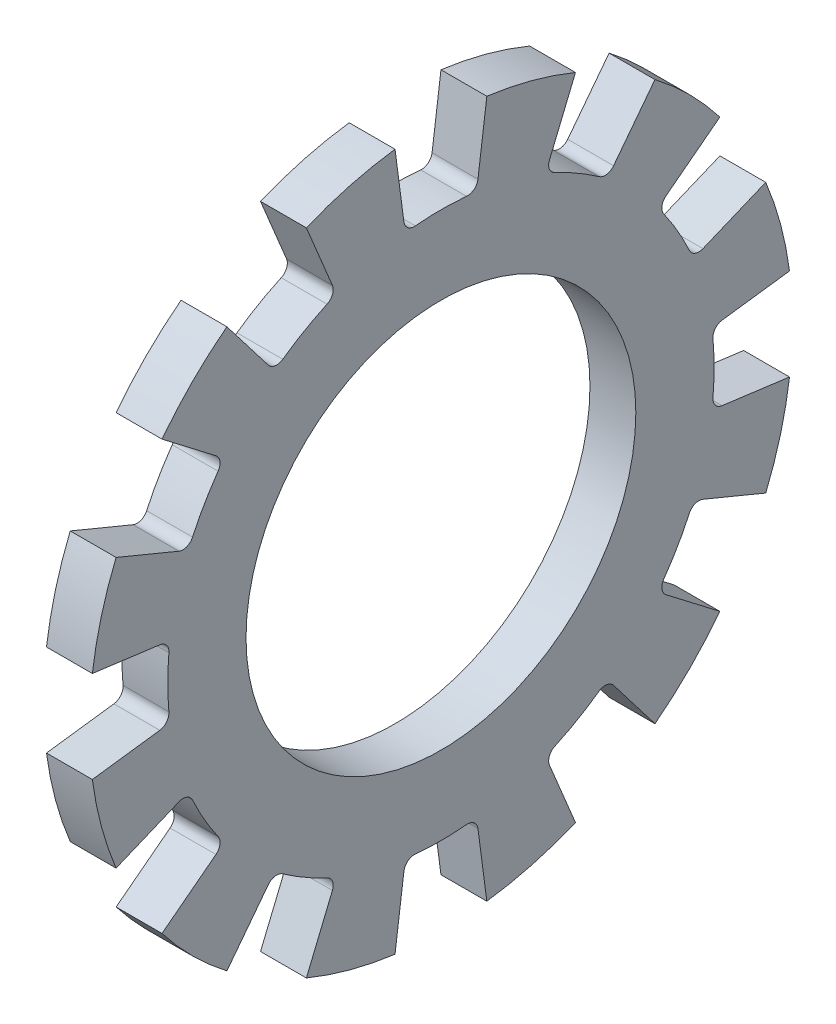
ISO-10303-21;
HEADER;
FILE_DESCRIPTION(('STEP AP214'),'2;1');
FILE_NAME('part.step','',(''),(''),'','','');
FILE_SCHEMA(('AUTOMOTIVE_DESIGN { 1 0 10303 214 1 1 1 1 }'));
ENDSEC;
DATA;
#1=APPLICATION_CONTEXT('core data for automotive mechanical design processes');
#2=APPLICATION_PROTOCOL_DEFINITION('international standard','automotive_design',2000,#1);
#3=PRODUCT_CONTEXT('',#1,'mechanical');
#4=PRODUCT('Part','Part','',(#3));
#5=PRODUCT_RELATED_PRODUCT_CATEGORY('part','',(#4));
#6=PRODUCT_DEFINITION_FORMATION('','',#4);
#7=PRODUCT_DEFINITION_CONTEXT('part definition',#1,'design');
#8=PRODUCT_DEFINITION('design','',#6,#7);
#9=PRODUCT_DEFINITION_SHAPE('','',#8);
#10=(LENGTH_UNIT() NAMED_UNIT(*) SI_UNIT(.MILLI.,.METRE.));
#11=(NAMED_UNIT(*) PLANE_ANGLE_UNIT() SI_UNIT($,.RADIAN.));
#12=(NAMED_UNIT(*) SI_UNIT($,.STERADIAN.) SOLID_ANGLE_UNIT());
#13=UNCERTAINTY_MEASURE_WITH_UNIT(LENGTH_MEASURE(1.E-05),#10,'distance_accuracy_value','');
#14=(GEOMETRIC_REPRESENTATION_CONTEXT(3) GLOBAL_UNCERTAINTY_ASSIGNED_CONTEXT((#13)) GLOBAL_UNIT_ASSIGNED_CONTEXT((#10,
#11,#12)) REPRESENTATION_CONTEXT('',''));
#15=CARTESIAN_POINT('',(0.,0.,0.));
#16=DIRECTION('',(0.,0.,1.));
#17=DIRECTION('',(1.,0.,0.));
#18=AXIS2_PLACEMENT_3D('',#15,#16,#17);
#19=CARTESIAN_POINT('',(0.,0.,0.));
#20=DIRECTION('',(-1.,0.,0.));
#21=DIRECTION('',(0.,0.,1.));
#22=AXIS2_PLACEMENT_3D('',#19,#20,#21);
#23=PLANE('',#22);
#24=DIRECTION('',(0.,0.793353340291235,-0.608761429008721));
#25=VECTOR('',#24,1.);
#26=CARTESIAN_POINT('',(0.,2.83623819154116,-2.17632210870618));
#27=LINE('',#26,#25);
#28=CARTESIAN_POINT('',(0.,2.94368569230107,-2.25876947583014));
#29=VERTEX_POINT('',#28);
#30=CARTESIAN_POINT('',(0.,3.64942536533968,-2.80030257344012));
#31=VERTEX_POINT('',#30);
#32=EDGE_CURVE('E493',#29,#31,#27,.T.);
#33=ORIENTED_EDGE('',*,*,#32,.T.);
#34=CARTESIAN_POINT('',(0.,0.,0.));
#35=DIRECTION('',(1.,0.,0.));
#36=DIRECTION('',(0.,0.,-1.));
#37=AXIS2_PLACEMENT_3D('',#34,#35,#36);
#38=CIRCLE('',#37,4.6);
#39=CARTESIAN_POINT('',(0.,2.80030257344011,-3.64942536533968));
#40=VERTEX_POINT('',#39);
#41=EDGE_CURVE('E763',#40,#31,#38,.T.);
#42=ORIENTED_EDGE('',*,*,#41,.F.);
#43=DIRECTION('',(0.,-0.60876142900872,0.793353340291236));
#44=VECTOR('',#43,1.);
#45=CARTESIAN_POINT('',(0.,2.80030257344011,-3.64942536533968));
#46=LINE('',#45,#44);
#47=CARTESIAN_POINT('',(0.,2.25876947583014,-2.94368569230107));
#48=VERTEX_POINT('',#47);
#49=EDGE_CURVE('E472',#40,#48,#46,.T.);
#50=ORIENTED_EDGE('',*,*,#49,.T.);
#51=CARTESIAN_POINT('',(0.,2.14928671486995,-3.02769476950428));
#52=DIRECTION('',(-1.,0.,0.));
#53=DIRECTION('',(0.,0.,1.));
#54=AXIS2_PLACEMENT_3D('',#51,#52,#53);
#55=CIRCLE('',#54,0.138);
#56=CARTESIAN_POINT('',(0.,2.06940479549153,-2.91516531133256));
#57=VERTEX_POINT('',#56);
#58=EDGE_CURVE('E21',#57,#48,#55,.T.);
#59=ORIENTED_EDGE('',*,*,#58,.F.);
#60=CARTESIAN_POINT('',(0.,0.,0.));
#61=DIRECTION('',(-1.,0.,0.));
#62=DIRECTION('',(0.,0.,1.));
#63=AXIS2_PLACEMENT_3D('',#60,#61,#62);
#64=CIRCLE('',#63,3.575);
#65=CARTESIAN_POINT('',(0.,1.48990481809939,-3.24973977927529));
#66=VERTEX_POINT('',#65);
#67=EDGE_CURVE('E470',#57,#66,#64,.T.);
#68=ORIENTED_EDGE('',*,*,#67,.T.);
#69=CARTESIAN_POINT('',(0.,1.54741722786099,-3.37518427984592));
#70=DIRECTION('',(-1.,0.,0.));
#71=DIRECTION('',(0.,0.,1.));
#72=AXIS2_PLACEMENT_3D('',#69,#70,#71);
#73=CIRCLE('',#72,0.138);
#74=CARTESIAN_POINT('',(0.,1.41992185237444,-3.4279945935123));
#75=VERTEX_POINT('',#74);
#76=EDGE_CURVE('E483',#75,#66,#73,.T.);
#77=ORIENTED_EDGE('',*,*,#76,.F.);
#78=DIRECTION('',(0.,0.382683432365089,-0.923879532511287));
#79=VECTOR('',#78,1.);
#80=CARTESIAN_POINT('',(0.,1.36809327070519,-3.30286932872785));
#81=LINE('',#80,#79);
#82=CARTESIAN_POINT('',(0.,1.76034378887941,-4.24984584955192));
#83=VERTEX_POINT('',#82);
#84=EDGE_CURVE('E593',#75,#83,#81,.T.);
#85=ORIENTED_EDGE('',*,*,#84,.T.);
#86=CARTESIAN_POINT('',(0.,0.,0.));
#87=DIRECTION('',(1.,0.,0.));
#88=DIRECTION('',(0.,0.,-1.));
#89=AXIS2_PLACEMENT_3D('',#86,#87,#88);
#90=CIRCLE('',#89,4.6);
#91=CARTESIAN_POINT('',(0.,0.600420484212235,-4.56064636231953));
#92=VERTEX_POINT('',#91);
#93=EDGE_CURVE('E893',#92,#83,#90,.T.);
#94=ORIENTED_EDGE('',*,*,#93,.F.);
#95=DIRECTION('',(0.,-0.130526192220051,0.99144486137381));
#96=VECTOR('',#95,1.);
#97=CARTESIAN_POINT('',(0.,0.600420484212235,-4.56064636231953));
#98=LINE('',#97,#96);
#99=CARTESIAN_POINT('',(0.,0.484308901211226,-3.67869132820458));
#100=VERTEX_POINT('',#99);
#101=EDGE_CURVE('E588',#92,#100,#98,.T.);
#102=ORIENTED_EDGE('',*,*,#101,.T.);
#103=CARTESIAN_POINT('',(0.,0.347489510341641,-3.69670394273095));
#104=DIRECTION('',(-1.,0.,0.));
#105=DIRECTION('',(0.,0.,1.));
#106=AXIS2_PLACEMENT_3D('',#103,#104,#105);
#107=CIRCLE('',#106,0.138);
#108=CARTESIAN_POINT('',(0.,0.334574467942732,-3.55930961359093));
#109=VERTEX_POINT('',#108);
#110=EDGE_CURVE('E591',#109,#100,#107,.T.);
#111=ORIENTED_EDGE('',*,*,#110,.F.);
#112=CARTESIAN_POINT('',(0.,0.,0.));
#113=DIRECTION('',(-1.,0.,0.));
#114=DIRECTION('',(0.,0.,1.));
#115=AXIS2_PLACEMENT_3D('',#112,#113,#114);
#116=CIRCLE('',#115,3.575);
#117=CARTESIAN_POINT('',(0.,-0.334574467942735,-3.55930961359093));
#118=VERTEX_POINT('',#117);
#119=EDGE_CURVE('E887',#109,#118,#116,.T.);
#120=ORIENTED_EDGE('',*,*,#119,.T.);
#121=CARTESIAN_POINT('',(0.,-0.347489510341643,-3.69670394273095));
#122=DIRECTION('',(-1.,0.,0.));
#123=DIRECTION('',(0.,0.,1.));
#124=AXIS2_PLACEMENT_3D('',#121,#122,#123);
#125=CIRCLE('',#124,0.138);
#126=CARTESIAN_POINT('',(0.,-0.484308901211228,-3.67869132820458));
#127=VERTEX_POINT('',#126);
#128=EDGE_CURVE('E885',#127,#118,#125,.T.);
#129=ORIENTED_EDGE('',*,*,#128,.F.);
#130=DIRECTION('',(0.,-0.130526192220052,-0.99144486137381));
#131=VECTOR('',#130,1.);
#132=CARTESIAN_POINT('',(0.,-0.466631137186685,-3.54441537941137));
#133=LINE('',#132,#131);
#134=CARTESIAN_POINT('',(0.,-0.600420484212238,-4.56064636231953));
#135=VERTEX_POINT('',#134);
#136=EDGE_CURVE('E584',#127,#135,#133,.T.);
#137=ORIENTED_EDGE('',*,*,#136,.T.);
#138=CARTESIAN_POINT('',(0.,0.,0.));
#139=DIRECTION('',(1.,0.,0.));
#140=DIRECTION('',(0.,0.,-1.));
#141=AXIS2_PLACEMENT_3D('',#138,#139,#140);
#142=CIRCLE('',#141,4.6);
#143=CARTESIAN_POINT('',(0.,-1.76034378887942,-4.24984584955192));
#144=VERTEX_POINT('',#143);
#145=EDGE_CURVE('E881',#144,#135,#142,.T.);
#146=ORIENTED_EDGE('',*,*,#145,.F.);
#147=DIRECTION('',(0.,0.38268343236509,0.923879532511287));
#148=VECTOR('',#147,1.);
#149=CARTESIAN_POINT('',(0.,-1.76034378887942,-4.24984584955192));
#150=LINE('',#149,#148);
#151=CARTESIAN_POINT('',(0.,-1.41992185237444,-3.4279945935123));
#152=VERTEX_POINT('',#151);
#153=EDGE_CURVE('E579',#144,#152,#150,.T.);
#154=ORIENTED_EDGE('',*,*,#153,.T.);
#155=CARTESIAN_POINT('',(0.,-1.547417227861,-3.37518427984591));
#156=DIRECTION('',(-1.,0.,0.));
#157=DIRECTION('',(0.,0.,1.));
#158=AXIS2_PLACEMENT_3D('',#155,#156,#157);
#159=CIRCLE('',#158,0.138);
#160=CARTESIAN_POINT('',(0.,-1.4899048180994,-3.24973977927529));
#161=VERTEX_POINT('',#160);
#162=EDGE_CURVE('E582',#161,#152,#159,.T.);
#163=ORIENTED_EDGE('',*,*,#162,.F.);
#164=CARTESIAN_POINT('',(0.,0.,0.));
#165=DIRECTION('',(-1.,0.,0.));
#166=DIRECTION('',(0.,0.,1.));
#167=AXIS2_PLACEMENT_3D('',#164,#165,#166);
#168=CIRCLE('',#167,3.575);
#169=CARTESIAN_POINT('',(0.,-2.06940479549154,-2.91516531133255));
#170=VERTEX_POINT('',#169);
#171=EDGE_CURVE('E875',#161,#170,#168,.T.);
#172=ORIENTED_EDGE('',*,*,#171,.T.);
#173=CARTESIAN_POINT('',(0.,-2.14928671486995,-3.02769476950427));
#174=DIRECTION('',(-1.,0.,0.));
#175=DIRECTION('',(0.,0.,1.));
#176=AXIS2_PLACEMENT_3D('',#173,#174,#175);
#177=CIRCLE('',#176,0.138);
#178=CARTESIAN_POINT('',(0.,-2.25876947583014,-2.94368569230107));
#179=VERTEX_POINT('',#178);
#180=EDGE_CURVE('E873',#179,#170,#177,.T.);
#181=ORIENTED_EDGE('',*,*,#180,.F.);
#182=DIRECTION('',(0.,-0.608761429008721,-0.793353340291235));
#183=VECTOR('',#182,1.);
#184=CARTESIAN_POINT('',(0.,-2.17632210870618,-2.83623819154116));
#185=LINE('',#184,#183);
#186=CARTESIAN_POINT('',(0.,-2.80030257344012,-3.64942536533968));
#187=VERTEX_POINT('',#186);
#188=EDGE_CURVE('E575',#179,#187,#185,.T.);
#189=ORIENTED_EDGE('',*,*,#188,.T.);
#190=CARTESIAN_POINT('',(0.,0.,0.));
#191=DIRECTION('',(1.,0.,0.));
#192=DIRECTION('',(0.,0.,-1.));
#193=AXIS2_PLACEMENT_3D('',#190,#191,#192);
#194=CIRCLE('',#193,4.6);
#195=CARTESIAN_POINT('',(0.,-3.64942536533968,-2.80030257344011));
#196=VERTEX_POINT('',#195);
#197=EDGE_CURVE('E869',#196,#187,#194,.T.);
#198=ORIENTED_EDGE('',*,*,#197,.F.);
#199=DIRECTION('',(0.,0.793353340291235,0.60876142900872));
#200=VECTOR('',#199,1.);
#201=CARTESIAN_POINT('',(0.,-3.64942536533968,-2.80030257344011));
#202=LINE('',#201,#200);
#203=CARTESIAN_POINT('',(0.,-2.94368569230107,-2.25876947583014));
#204=VERTEX_POINT('',#203);
#205=EDGE_CURVE('E570',#196,#204,#202,.T.);
#206=ORIENTED_EDGE('',*,*,#205,.T.);
#207=CARTESIAN_POINT('',(0.,-3.02769476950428,-2.14928671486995));
#208=DIRECTION('',(-1.,0.,0.));
#209=DIRECTION('',(0.,0.,1.));
#210=AXIS2_PLACEMENT_3D('',#207,#208,#209);
#211=CIRCLE('',#210,0.138);
#212=CARTESIAN_POINT('',(0.,-2.91516531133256,-2.06940479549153));
#213=VERTEX_POINT('',#212);
#214=EDGE_CURVE('E573',#213,#204,#211,.T.);
#215=ORIENTED_EDGE('',*,*,#214,.F.);
#216=CARTESIAN_POINT('',(0.,0.,0.));
#217=DIRECTION('',(-1.,0.,0.));
#218=DIRECTION('',(0.,0.,1.));
#219=AXIS2_PLACEMENT_3D('',#216,#217,#218);
#220=CIRCLE('',#219,3.575);
#221=CARTESIAN_POINT('',(0.,-3.24973977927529,-1.4899048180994));
#222=VERTEX_POINT('',#221);
#223=EDGE_CURVE('E863',#213,#222,#220,.T.);
#224=ORIENTED_EDGE('',*,*,#223,.T.);
#225=CARTESIAN_POINT('',(0.,-3.37518427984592,-1.547417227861));
#226=DIRECTION('',(-1.,0.,0.));
#227=DIRECTION('',(0.,0.,1.));
#228=AXIS2_PLACEMENT_3D('',#225,#226,#227);
#229=CIRCLE('',#228,0.138);
#230=CARTESIAN_POINT('',(0.,-3.4279945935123,-1.41992185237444));
#231=VERTEX_POINT('',#230);
#232=EDGE_CURVE('E861',#231,#222,#229,.T.);
#233=ORIENTED_EDGE('',*,*,#232,.F.);
#234=DIRECTION('',(0.,-0.923879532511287,-0.38268343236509));
#235=VECTOR('',#234,1.);
#236=CARTESIAN_POINT('',(0.,-3.30286932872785,-1.36809327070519));
#237=LINE('',#236,#235);
#238=CARTESIAN_POINT('',(0.,-4.24984584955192,-1.76034378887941));
#239=VERTEX_POINT('',#238);
#240=EDGE_CURVE('E566',#231,#239,#237,.T.);
#241=ORIENTED_EDGE('',*,*,#240,.T.);
#242=CARTESIAN_POINT('',(0.,0.,0.));
#243=DIRECTION('',(1.,0.,0.));
#244=DIRECTION('',(0.,0.,-1.));
#245=AXIS2_PLACEMENT_3D('',#242,#243,#244);
#246=CIRCLE('',#245,4.6);
#247=CARTESIAN_POINT('',(0.,-4.56064636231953,-0.600420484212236));
#248=VERTEX_POINT('',#247);
#249=EDGE_CURVE('E857',#248,#239,#246,.T.);
#250=ORIENTED_EDGE('',*,*,#249,.F.);
#251=DIRECTION('',(0.,0.99144486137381,0.130526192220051));
#252=VECTOR('',#251,1.);
#253=CARTESIAN_POINT('',(0.,-4.56064636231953,-0.600420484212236));
#254=LINE('',#253,#252);
#255=CARTESIAN_POINT('',(0.,-3.67869132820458,-0.484308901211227));
#256=VERTEX_POINT('',#255);
#257=EDGE_CURVE('E561',#248,#256,#254,.T.);
#258=ORIENTED_EDGE('',*,*,#257,.T.);
#259=CARTESIAN_POINT('',(0.,-3.69670394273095,-0.347489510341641));
#260=DIRECTION('',(-1.,0.,0.));
#261=DIRECTION('',(0.,0.,1.));
#262=AXIS2_PLACEMENT_3D('',#259,#260,#261);
#263=CIRCLE('',#262,0.138);
#264=CARTESIAN_POINT('',(0.,-3.55930961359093,-0.334574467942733));
#265=VERTEX_POINT('',#264);
#266=EDGE_CURVE('E564',#265,#256,#263,.T.);
#267=ORIENTED_EDGE('',*,*,#266,.F.);
#268=CARTESIAN_POINT('',(0.,0.,0.));
#269=DIRECTION('',(-1.,0.,0.));
#270=DIRECTION('',(0.,0.,1.));
#271=AXIS2_PLACEMENT_3D('',#268,#269,#270);
#272=CIRCLE('',#271,3.575);
#273=CARTESIAN_POINT('',(0.,-3.55930961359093,0.334574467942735));
#274=VERTEX_POINT('',#273);
#275=EDGE_CURVE('E851',#265,#274,#272,.T.);
#276=ORIENTED_EDGE('',*,*,#275,.T.);
#277=CARTESIAN_POINT('',(0.,-3.69670394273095,0.347489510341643));
#278=DIRECTION('',(-1.,0.,0.));
#279=DIRECTION('',(0.,0.,1.));
#280=AXIS2_PLACEMENT_3D('',#277,#278,#279);
#281=CIRCLE('',#280,0.138);
#282=CARTESIAN_POINT('',(0.,-3.67869132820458,0.484308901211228));
#283=VERTEX_POINT('',#282);
#284=EDGE_CURVE('E849',#283,#274,#281,.T.);
#285=ORIENTED_EDGE('',*,*,#284,.F.);
#286=DIRECTION('',(0.,-0.99144486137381,0.130526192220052));
#287=VECTOR('',#286,1.);
#288=CARTESIAN_POINT('',(0.,-3.54441537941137,0.466631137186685));
#289=LINE('',#288,#287);
#290=CARTESIAN_POINT('',(0.,-4.56064636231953,0.600420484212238));
#291=VERTEX_POINT('',#290);
#292=EDGE_CURVE('E557',#283,#291,#289,.T.);
#293=ORIENTED_EDGE('',*,*,#292,.T.);
#294=CARTESIAN_POINT('',(0.,0.,0.));
#295=DIRECTION('',(1.,0.,0.));
#296=DIRECTION('',(0.,0.,-1.));
#297=AXIS2_PLACEMENT_3D('',#294,#295,#296);
#298=CIRCLE('',#297,4.6);
#299=CARTESIAN_POINT('',(0.,-4.24984584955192,1.76034378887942));
#300=VERTEX_POINT('',#299);
#301=EDGE_CURVE('E845',#300,#291,#298,.T.);
#302=ORIENTED_EDGE('',*,*,#301,.F.);
#303=DIRECTION('',(0.,0.923879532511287,-0.38268343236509));
#304=VECTOR('',#303,1.);
#305=CARTESIAN_POINT('',(0.,-4.24984584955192,1.76034378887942));
#306=LINE('',#305,#304);
#307=CARTESIAN_POINT('',(0.,-3.4279945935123,1.41992185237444));
#308=VERTEX_POINT('',#307);
#309=EDGE_CURVE('E552',#300,#308,#306,.T.);
#310=ORIENTED_EDGE('',*,*,#309,.T.);
#311=CARTESIAN_POINT('',(0.,-3.37518427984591,1.547417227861));
#312=DIRECTION('',(-1.,0.,0.));
#313=DIRECTION('',(0.,0.,1.));
#314=AXIS2_PLACEMENT_3D('',#311,#312,#313);
#315=CIRCLE('',#314,0.138);
#316=CARTESIAN_POINT('',(0.,-3.24973977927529,1.4899048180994));
#317=VERTEX_POINT('',#316);
#318=EDGE_CURVE('E555',#317,#308,#315,.T.);
#319=ORIENTED_EDGE('',*,*,#318,.F.);
#320=CARTESIAN_POINT('',(0.,0.,0.));
#321=DIRECTION('',(-1.,0.,0.));
#322=DIRECTION('',(0.,0.,1.));
#323=AXIS2_PLACEMENT_3D('',#320,#321,#322);
#324=CIRCLE('',#323,3.575);
#325=CARTESIAN_POINT('',(0.,-2.91516531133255,2.06940479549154));
#326=VERTEX_POINT('',#325);
#327=EDGE_CURVE('E839',#317,#326,#324,.T.);
#328=ORIENTED_EDGE('',*,*,#327,.T.);
#329=CARTESIAN_POINT('',(0.,-3.02769476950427,2.14928671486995));
#330=DIRECTION('',(-1.,0.,0.));
#331=DIRECTION('',(0.,0.,1.));
#332=AXIS2_PLACEMENT_3D('',#329,#330,#331);
#333=CIRCLE('',#332,0.138);
#334=CARTESIAN_POINT('',(0.,-2.94368569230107,2.25876947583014));
#335=VERTEX_POINT('',#334);
#336=EDGE_CURVE('E837',#335,#326,#333,.T.);
#337=ORIENTED_EDGE('',*,*,#336,.F.);
#338=DIRECTION('',(0.,-0.793353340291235,0.608761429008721));
#339=VECTOR('',#338,1.);
#340=CARTESIAN_POINT('',(0.,-2.83623819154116,2.17632210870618));
#341=LINE('',#340,#339);
#342=CARTESIAN_POINT('',(0.,-3.64942536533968,2.80030257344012));
#343=VERTEX_POINT('',#342);
#344=EDGE_CURVE('E548',#335,#343,#341,.T.);
#345=ORIENTED_EDGE('',*,*,#344,.T.);
#346=CARTESIAN_POINT('',(0.,0.,0.));
#347=DIRECTION('',(1.,0.,0.));
#348=DIRECTION('',(0.,0.,-1.));
#349=AXIS2_PLACEMENT_3D('',#346,#347,#348);
#350=CIRCLE('',#349,4.6);
#351=CARTESIAN_POINT('',(0.,-2.80030257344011,3.64942536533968));
#352=VERTEX_POINT('',#351);
#353=EDGE_CURVE('E833',#352,#343,#350,.T.);
#354=ORIENTED_EDGE('',*,*,#353,.F.);
#355=DIRECTION('',(0.,0.60876142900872,-0.793353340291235));
#356=VECTOR('',#355,1.);
#357=CARTESIAN_POINT('',(0.,-2.80030257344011,3.64942536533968));
#358=LINE('',#357,#356);
#359=CARTESIAN_POINT('',(0.,-2.25876947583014,2.94368569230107));
#360=VERTEX_POINT('',#359);
#361=EDGE_CURVE('E543',#352,#360,#358,.T.);
#362=ORIENTED_EDGE('',*,*,#361,.T.);
#363=CARTESIAN_POINT('',(0.,-2.14928671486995,3.02769476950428));
#364=DIRECTION('',(-1.,0.,0.));
#365=DIRECTION('',(0.,0.,1.));
#366=AXIS2_PLACEMENT_3D('',#363,#364,#365);
#367=CIRCLE('',#366,0.138);
#368=CARTESIAN_POINT('',(0.,-2.06940479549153,2.91516531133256));
#369=VERTEX_POINT('',#368);
#370=EDGE_CURVE('E546',#369,#360,#367,.T.);
#371=ORIENTED_EDGE('',*,*,#370,.F.);
#372=CARTESIAN_POINT('',(0.,0.,0.));
#373=DIRECTION('',(-1.,0.,0.));
#374=DIRECTION('',(0.,0.,1.));
#375=AXIS2_PLACEMENT_3D('',#372,#373,#374);
#376=CIRCLE('',#375,3.575);
#377=CARTESIAN_POINT('',(0.,-1.4899048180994,3.24973977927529));
#378=VERTEX_POINT('',#377);
#379=EDGE_CURVE('E827',#369,#378,#376,.T.);
#380=ORIENTED_EDGE('',*,*,#379,.T.);
#381=CARTESIAN_POINT('',(0.,-1.547417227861,3.37518427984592));
#382=DIRECTION('',(-1.,0.,0.));
#383=DIRECTION('',(0.,0.,1.));
#384=AXIS2_PLACEMENT_3D('',#381,#382,#383);
#385=CIRCLE('',#384,0.138);
#386=CARTESIAN_POINT('',(0.,-1.41992185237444,3.4279945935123));
#387=VERTEX_POINT('',#386);
#388=EDGE_CURVE('E825',#387,#378,#385,.T.);
#389=ORIENTED_EDGE('',*,*,#388,.F.);
#390=DIRECTION('',(0.,-0.38268343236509,0.923879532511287));
#391=VECTOR('',#390,1.);
#392=CARTESIAN_POINT('',(0.,-1.36809327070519,3.30286932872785));
#393=LINE('',#392,#391);
#394=CARTESIAN_POINT('',(0.,-1.76034378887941,4.24984584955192));
#395=VERTEX_POINT('',#394);
#396=EDGE_CURVE('E539',#387,#395,#393,.T.);
#397=ORIENTED_EDGE('',*,*,#396,.T.);
#398=CARTESIAN_POINT('',(0.,0.,0.));
#399=DIRECTION('',(1.,0.,0.));
#400=DIRECTION('',(0.,0.,-1.));
#401=AXIS2_PLACEMENT_3D('',#398,#399,#400);
#402=CIRCLE('',#401,4.6);
#403=CARTESIAN_POINT('',(0.,-0.600420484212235,4.56064636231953));
#404=VERTEX_POINT('',#403);
#405=EDGE_CURVE('E821',#404,#395,#402,.T.);
#406=ORIENTED_EDGE('',*,*,#405,.F.);
#407=DIRECTION('',(0.,0.130526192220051,-0.99144486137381));
#408=VECTOR('',#407,1.);
#409=CARTESIAN_POINT('',(0.,-0.600420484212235,4.56064636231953));
#410=LINE('',#409,#408);
#411=CARTESIAN_POINT('',(0.,-0.484308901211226,3.67869132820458));
#412=VERTEX_POINT('',#411);
#413=EDGE_CURVE('E534',#404,#412,#410,.T.);
#414=ORIENTED_EDGE('',*,*,#413,.T.);
#415=CARTESIAN_POINT('',(0.,-0.347489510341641,3.69670394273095));
#416=DIRECTION('',(-1.,0.,0.));
#417=DIRECTION('',(0.,0.,1.));
#418=AXIS2_PLACEMENT_3D('',#415,#416,#417);
#419=CIRCLE('',#418,0.138);
#420=CARTESIAN_POINT('',(0.,-0.334574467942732,3.55930961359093));
#421=VERTEX_POINT('',#420);
#422=EDGE_CURVE('E537',#421,#412,#419,.T.);
#423=ORIENTED_EDGE('',*,*,#422,.F.);
#424=CARTESIAN_POINT('',(0.,0.,0.));
#425=DIRECTION('',(-1.,0.,0.));
#426=DIRECTION('',(0.,0.,1.));
#427=AXIS2_PLACEMENT_3D('',#424,#425,#426);
#428=CIRCLE('',#427,3.575);
#429=CARTESIAN_POINT('',(0.,0.334574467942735,3.55930961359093));
#430=VERTEX_POINT('',#429);
#431=EDGE_CURVE('E815',#421,#430,#428,.T.);
#432=ORIENTED_EDGE('',*,*,#431,.T.);
#433=CARTESIAN_POINT('',(0.,0.347489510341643,3.69670394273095));
#434=DIRECTION('',(-1.,0.,0.));
#435=DIRECTION('',(0.,0.,1.));
#436=AXIS2_PLACEMENT_3D('',#433,#434,#435);
#437=CIRCLE('',#436,0.138);
#438=CARTESIAN_POINT('',(0.,0.484308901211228,3.67869132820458));
#439=VERTEX_POINT('',#438);
#440=EDGE_CURVE('E813',#439,#430,#437,.T.);
#441=ORIENTED_EDGE('',*,*,#440,.F.);
#442=DIRECTION('',(0.,0.130526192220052,0.99144486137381));
#443=VECTOR('',#442,1.);
#444=CARTESIAN_POINT('',(0.,0.466631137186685,3.54441537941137));
#445=LINE('',#444,#443);
#446=CARTESIAN_POINT('',(0.,0.600420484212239,4.56064636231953));
#447=VERTEX_POINT('',#446);
#448=EDGE_CURVE('E530',#439,#447,#445,.T.);
#449=ORIENTED_EDGE('',*,*,#448,.T.);
#450=CARTESIAN_POINT('',(0.,0.,0.));
#451=DIRECTION('',(1.,0.,0.));
#452=DIRECTION('',(0.,0.,-1.));
#453=AXIS2_PLACEMENT_3D('',#450,#451,#452);
#454=CIRCLE('',#453,4.6);
#455=CARTESIAN_POINT('',(0.,1.76034378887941,4.24984584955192));
#456=VERTEX_POINT('',#455);
#457=EDGE_CURVE('E809',#456,#447,#454,.T.);
#458=ORIENTED_EDGE('',*,*,#457,.F.);
#459=DIRECTION('',(0.,-0.38268343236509,-0.923879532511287));
#460=VECTOR('',#459,1.);
#461=CARTESIAN_POINT('',(0.,1.76034378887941,4.24984584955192));
#462=LINE('',#461,#460);
#463=CARTESIAN_POINT('',(0.,1.41992185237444,3.4279945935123));
#464=VERTEX_POINT('',#463);
#465=EDGE_CURVE('E525',#456,#464,#462,.T.);
#466=ORIENTED_EDGE('',*,*,#465,.T.);
#467=CARTESIAN_POINT('',(0.,1.547417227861,3.37518427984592));
#468=DIRECTION('',(-1.,0.,0.));
#469=DIRECTION('',(0.,0.,1.));
#470=AXIS2_PLACEMENT_3D('',#467,#468,#469);
#471=CIRCLE('',#470,0.138);
#472=CARTESIAN_POINT('',(0.,1.4899048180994,3.24973977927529));
#473=VERTEX_POINT('',#472);
#474=EDGE_CURVE('E528',#473,#464,#471,.T.);
#475=ORIENTED_EDGE('',*,*,#474,.F.);
#476=CARTESIAN_POINT('',(0.,0.,0.));
#477=DIRECTION('',(-1.,0.,0.));
#478=DIRECTION('',(0.,0.,1.));
#479=AXIS2_PLACEMENT_3D('',#476,#477,#478);
#480=CIRCLE('',#479,3.575);
#481=CARTESIAN_POINT('',(0.,2.06940479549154,2.91516531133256));
#482=VERTEX_POINT('',#481);
#483=EDGE_CURVE('E803',#473,#482,#480,.T.);
#484=ORIENTED_EDGE('',*,*,#483,.T.);
#485=CARTESIAN_POINT('',(0.,2.14928671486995,3.02769476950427));
#486=DIRECTION('',(-1.,0.,0.));
#487=DIRECTION('',(0.,0.,1.));
#488=AXIS2_PLACEMENT_3D('',#485,#486,#487);
#489=CIRCLE('',#488,0.138);
#490=CARTESIAN_POINT('',(0.,2.25876947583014,2.94368569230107));
#491=VERTEX_POINT('',#490);
#492=EDGE_CURVE('E801',#491,#482,#489,.T.);
#493=ORIENTED_EDGE('',*,*,#492,.F.);
#494=DIRECTION('',(0.,0.608761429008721,0.793353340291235));
#495=VECTOR('',#494,1.);
#496=CARTESIAN_POINT('',(0.,2.17632210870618,2.83623819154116));
#497=LINE('',#496,#495);
#498=CARTESIAN_POINT('',(0.,2.80030257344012,3.64942536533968));
#499=VERTEX_POINT('',#498);
#500=EDGE_CURVE('E521',#491,#499,#497,.T.);
#501=ORIENTED_EDGE('',*,*,#500,.T.);
#502=CARTESIAN_POINT('',(0.,0.,0.));
#503=DIRECTION('',(1.,0.,0.));
#504=DIRECTION('',(0.,0.,-1.));
#505=AXIS2_PLACEMENT_3D('',#502,#503,#504);
#506=CIRCLE('',#505,4.6);
#507=CARTESIAN_POINT('',(0.,3.64942536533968,2.80030257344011));
#508=VERTEX_POINT('',#507);
#509=EDGE_CURVE('E797',#508,#499,#506,.T.);
#510=ORIENTED_EDGE('',*,*,#509,.F.);
#511=DIRECTION('',(0.,-0.793353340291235,-0.60876142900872));
#512=VECTOR('',#511,1.);
#513=CARTESIAN_POINT('',(0.,3.64942536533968,2.80030257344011));
#514=LINE('',#513,#512);
#515=CARTESIAN_POINT('',(0.,2.94368569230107,2.25876947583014));
#516=VERTEX_POINT('',#515);
#517=EDGE_CURVE('E516',#508,#516,#514,.T.);
#518=ORIENTED_EDGE('',*,*,#517,.T.);
#519=CARTESIAN_POINT('',(0.,3.02769476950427,2.14928671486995));
#520=DIRECTION('',(-1.,0.,0.));
#521=DIRECTION('',(0.,0.,1.));
#522=AXIS2_PLACEMENT_3D('',#519,#520,#521);
#523=CIRCLE('',#522,0.138);
#524=CARTESIAN_POINT('',(0.,2.91516531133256,2.06940479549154));
#525=VERTEX_POINT('',#524);
#526=EDGE_CURVE('E519',#525,#516,#523,.T.);
#527=ORIENTED_EDGE('',*,*,#526,.F.);
#528=CARTESIAN_POINT('',(0.,0.,0.));
#529=DIRECTION('',(-1.,0.,0.));
#530=DIRECTION('',(0.,0.,1.));
#531=AXIS2_PLACEMENT_3D('',#528,#529,#530);
#532=CIRCLE('',#531,3.575);
#533=CARTESIAN_POINT('',(0.,3.24973977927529,1.4899048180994));
#534=VERTEX_POINT('',#533);
#535=EDGE_CURVE('E791',#525,#534,#532,.T.);
#536=ORIENTED_EDGE('',*,*,#535,.T.);
#537=CARTESIAN_POINT('',(0.,3.37518427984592,1.547417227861));
#538=DIRECTION('',(-1.,0.,0.));
#539=DIRECTION('',(0.,0.,1.));
#540=AXIS2_PLACEMENT_3D('',#537,#538,#539);
#541=CIRCLE('',#540,0.138);
#542=CARTESIAN_POINT('',(0.,3.4279945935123,1.41992185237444));
#543=VERTEX_POINT('',#542);
#544=EDGE_CURVE('E789',#543,#534,#541,.T.);
#545=ORIENTED_EDGE('',*,*,#544,.F.);
#546=DIRECTION('',(0.,0.923879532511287,0.38268343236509));
#547=VECTOR('',#546,1.);
#548=CARTESIAN_POINT('',(0.,3.30286932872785,1.3680932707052));
#549=LINE('',#548,#547);
#550=CARTESIAN_POINT('',(0.,4.24984584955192,1.76034378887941));
#551=VERTEX_POINT('',#550);
#552=EDGE_CURVE('E512',#543,#551,#549,.T.);
#553=ORIENTED_EDGE('',*,*,#552,.T.);
#554=CARTESIAN_POINT('',(0.,0.,0.));
#555=DIRECTION('',(1.,0.,0.));
#556=DIRECTION('',(0.,0.,-1.));
#557=AXIS2_PLACEMENT_3D('',#554,#555,#556);
#558=CIRCLE('',#557,4.6);
#559=CARTESIAN_POINT('',(0.,4.56064636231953,0.600420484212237));
#560=VERTEX_POINT('',#559);
#561=EDGE_CURVE('E785',#560,#551,#558,.T.);
#562=ORIENTED_EDGE('',*,*,#561,.F.);
#563=DIRECTION('',(0.,-0.991444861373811,-0.130526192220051));
#564=VECTOR('',#563,1.);
#565=CARTESIAN_POINT('',(0.,4.56064636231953,0.600420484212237));
#566=LINE('',#565,#564);
#567=CARTESIAN_POINT('',(0.,3.67869132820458,0.484308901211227));
#568=VERTEX_POINT('',#567);
#569=EDGE_CURVE('E507',#560,#568,#566,.T.);
#570=ORIENTED_EDGE('',*,*,#569,.T.);
#571=CARTESIAN_POINT('',(0.,3.69670394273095,0.347489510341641));
#572=DIRECTION('',(-1.,0.,0.));
#573=DIRECTION('',(0.,0.,1.));
#574=AXIS2_PLACEMENT_3D('',#571,#572,#573);
#575=CIRCLE('',#574,0.138);
#576=CARTESIAN_POINT('',(0.,3.55930961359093,0.334574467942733));
#577=VERTEX_POINT('',#576);
#578=EDGE_CURVE('E510',#577,#568,#575,.T.);
#579=ORIENTED_EDGE('',*,*,#578,.F.);
#580=CARTESIAN_POINT('',(0.,0.,0.));
#581=DIRECTION('',(-1.,0.,0.));
#582=DIRECTION('',(0.,0.,1.));
#583=AXIS2_PLACEMENT_3D('',#580,#581,#582);
#584=CIRCLE('',#583,3.575);
#585=CARTESIAN_POINT('',(0.,3.55930961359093,-0.334574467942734));
#586=VERTEX_POINT('',#585);
#587=EDGE_CURVE('E779',#577,#586,#584,.T.);
#588=ORIENTED_EDGE('',*,*,#587,.T.);
#589=CARTESIAN_POINT('',(0.,3.69670394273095,-0.347489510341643));
#590=DIRECTION('',(-1.,0.,0.));
#591=DIRECTION('',(0.,0.,1.));
#592=AXIS2_PLACEMENT_3D('',#589,#590,#591);
#593=CIRCLE('',#592,0.138);
#594=CARTESIAN_POINT('',(0.,3.67869132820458,-0.484308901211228));
#595=VERTEX_POINT('',#594);
#596=EDGE_CURVE('E777',#595,#586,#593,.T.);
#597=ORIENTED_EDGE('',*,*,#596,.F.);
#598=DIRECTION('',(0.,0.99144486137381,-0.130526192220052));
#599=VECTOR('',#598,1.);
#600=CARTESIAN_POINT('',(0.,3.54441537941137,-0.466631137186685));
#601=LINE('',#600,#599);
#602=CARTESIAN_POINT('',(0.,4.56064636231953,-0.600420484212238));
#603=VERTEX_POINT('',#602);
#604=EDGE_CURVE('E502',#595,#603,#601,.T.);
#605=ORIENTED_EDGE('',*,*,#604,.T.);
#606=CARTESIAN_POINT('',(0.,0.,0.));
#607=DIRECTION('',(1.,0.,0.));
#608=DIRECTION('',(0.,0.,-1.));
#609=AXIS2_PLACEMENT_3D('',#606,#607,#608);
#610=CIRCLE('',#609,4.6);
#611=CARTESIAN_POINT('',(0.,4.24984584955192,-1.76034378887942));
#612=VERTEX_POINT('',#611);
#613=EDGE_CURVE('E774',#612,#603,#610,.T.);
#614=ORIENTED_EDGE('',*,*,#613,.F.);
#615=DIRECTION('',(0.,-0.923879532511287,0.38268343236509));
#616=VECTOR('',#615,1.);
#617=CARTESIAN_POINT('',(0.,4.24984584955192,-1.76034378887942));
#618=LINE('',#617,#616);
#619=CARTESIAN_POINT('',(0.,3.4279945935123,-1.41992185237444));
#620=VERTEX_POINT('',#619);
#621=EDGE_CURVE('E497',#612,#620,#618,.T.);
#622=ORIENTED_EDGE('',*,*,#621,.T.);
#623=CARTESIAN_POINT('',(0.,3.37518427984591,-1.547417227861));
#624=DIRECTION('',(-1.,0.,0.));
#625=DIRECTION('',(0.,0.,1.));
#626=AXIS2_PLACEMENT_3D('',#623,#624,#625);
#627=CIRCLE('',#626,0.138);
#628=CARTESIAN_POINT('',(0.,3.24973977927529,-1.4899048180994));
#629=VERTEX_POINT('',#628);
#630=EDGE_CURVE('E500',#629,#620,#627,.T.);
#631=ORIENTED_EDGE('',*,*,#630,.F.);
#632=CARTESIAN_POINT('',(0.,0.,0.));
#633=DIRECTION('',(-1.,0.,0.));
#634=DIRECTION('',(0.,0.,1.));
#635=AXIS2_PLACEMENT_3D('',#632,#633,#634);
#636=CIRCLE('',#635,3.575);
#637=CARTESIAN_POINT('',(0.,2.91516531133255,-2.06940479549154));
#638=VERTEX_POINT('',#637);
#639=EDGE_CURVE('E768',#629,#638,#636,.T.);
#640=ORIENTED_EDGE('',*,*,#639,.T.);
#641=CARTESIAN_POINT('',(0.,3.02769476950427,-2.14928671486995));
#642=DIRECTION('',(-1.,0.,0.));
#643=DIRECTION('',(0.,0.,1.));
#644=AXIS2_PLACEMENT_3D('',#641,#642,#643);
#645=CIRCLE('',#644,0.138);
#646=EDGE_CURVE('E766',#29,#638,#645,.T.);
#647=ORIENTED_EDGE('',*,*,#646,.F.);
#648=EDGE_LOOP('',(#33,#42,#50,#59,#68,#77,#85,#94,#102,#111,#120,#129,#137,#146,#154,#163,#172,
#181,#189,#198,#206,#215,#224,#233,#241,#250,#258,#267,#276,#285,#293,#302,#310,#319,#328,#337,
#345,#354,#362,#371,#380,#389,#397,#406,#414,#423,#432,#441,#449,#458,#466,#475,#484,#493,#501,
#510,#518,#527,#536,#545,#553,#562,#570,#579,#588,#597,#605,#614,#622,#631,#640,#647));
#649=FACE_BOUND('',#648,.T.);
#650=CARTESIAN_POINT('',(0.,0.,0.));
#651=DIRECTION('',(1.,0.,0.));
#652=DIRECTION('',(0.,0.,-1.));
#653=AXIS2_PLACEMENT_3D('',#650,#651,#652);
#654=CIRCLE('',#653,2.55);
#655=CARTESIAN_POINT('',(0.,0.,-2.55));
#656=VERTEX_POINT('',#655);
#657=EDGE_CURVE('E760',#656,#656,#654,.T.);
#658=ORIENTED_EDGE('',*,*,#657,.T.);
#659=EDGE_LOOP('',(#658));
#660=FACE_BOUND('',#659,.T.);
#661=ADVANCED_FACE('F17',(#649,#660),#23,.T.);
#662=CARTESIAN_POINT('',(0.6,2.14928671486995,-3.02769476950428));
#663=DIRECTION('',(-1.,0.,0.));
#664=DIRECTION('',(0.,0.,1.));
#665=AXIS2_PLACEMENT_3D('',#662,#663,#664);
#666=CYLINDRICAL_SURFACE('',#665,0.138);
#667=ORIENTED_EDGE('',*,*,#58,.T.);
#668=DIRECTION('',(1.,0.,0.));
#669=VECTOR('',#668,1.);
#670=CARTESIAN_POINT('',(0.,2.25876947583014,-2.94368569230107));
#671=LINE('',#670,#669);
#672=CARTESIAN_POINT('',(0.6,2.25876947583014,-2.94368569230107));
#673=VERTEX_POINT('',#672);
#674=EDGE_CURVE('E492',#48,#673,#671,.T.);
#675=ORIENTED_EDGE('',*,*,#674,.T.);
#676=CARTESIAN_POINT('',(0.6,2.14928671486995,-3.02769476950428));
#677=DIRECTION('',(-1.,0.,0.));
#678=DIRECTION('',(0.,0.,1.));
#679=AXIS2_PLACEMENT_3D('',#676,#677,#678);
#680=CIRCLE('',#679,0.138);
#681=CARTESIAN_POINT('',(0.6,2.06940479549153,-2.91516531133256));
#682=VERTEX_POINT('',#681);
#683=EDGE_CURVE('E486',#673,#682,#680,.F.);
#684=ORIENTED_EDGE('',*,*,#683,.T.);
#685=DIRECTION('',(-1.,0.,0.));
#686=VECTOR('',#685,1.);
#687=CARTESIAN_POINT('',(0.,2.06940479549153,-2.91516531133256));
#688=LINE('',#687,#686);
#689=EDGE_CURVE('E477',#682,#57,#688,.T.);
#690=ORIENTED_EDGE('',*,*,#689,.T.);
#691=EDGE_LOOP('',(#667,#675,#684,#690));
#692=FACE_BOUND('',#691,.T.);
#693=ADVANCED_FACE('F485',(#692),#666,.F.);
#694=CARTESIAN_POINT('',(0.6,0.,0.));
#695=DIRECTION('',(-1.,0.,0.));
#696=DIRECTION('',(0.,0.,1.));
#697=AXIS2_PLACEMENT_3D('',#694,#695,#696);
#698=CYLINDRICAL_SURFACE('',#697,3.575);
#699=ORIENTED_EDGE('',*,*,#67,.F.);
#700=ORIENTED_EDGE('',*,*,#689,.F.);
#701=CARTESIAN_POINT('',(0.6,0.,0.));
#702=DIRECTION('',(-1.,0.,0.));
#703=DIRECTION('',(0.,0.,1.));
#704=AXIS2_PLACEMENT_3D('',#701,#702,#703);
#705=CIRCLE('',#704,3.575);
#706=CARTESIAN_POINT('',(0.6,1.48990481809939,-3.24973977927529));
#707=VERTEX_POINT('',#706);
#708=EDGE_CURVE('E757',#682,#707,#705,.T.);
#709=ORIENTED_EDGE('',*,*,#708,.T.);
#710=DIRECTION('',(-1.,0.,0.));
#711=VECTOR('',#710,1.);
#712=CARTESIAN_POINT('',(0.,1.48990481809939,-3.24973977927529));
#713=LINE('',#712,#711);
#714=EDGE_CURVE('E482',#66,#707,#713,.F.);
#715=ORIENTED_EDGE('',*,*,#714,.F.);
#716=EDGE_LOOP('',(#699,#700,#709,#715));
#717=FACE_BOUND('',#716,.T.);
#718=ADVANCED_FACE('F479',(#717),#698,.T.);
#719=CARTESIAN_POINT('',(0.6,1.54741722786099,-3.37518427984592));
#720=DIRECTION('',(-1.,0.,0.));
#721=DIRECTION('',(0.,0.,1.));
#722=AXIS2_PLACEMENT_3D('',#719,#720,#721);
#723=CYLINDRICAL_SURFACE('',#722,0.138);
#724=ORIENTED_EDGE('',*,*,#76,.T.);
#725=ORIENTED_EDGE('',*,*,#714,.T.);
#726=CARTESIAN_POINT('',(0.6,1.54741722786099,-3.37518427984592));
#727=DIRECTION('',(-1.,0.,0.));
#728=DIRECTION('',(0.,0.,1.));
#729=AXIS2_PLACEMENT_3D('',#726,#727,#728);
#730=CIRCLE('',#729,0.138);
#731=CARTESIAN_POINT('',(0.6,1.41992185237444,-3.4279945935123));
#732=VERTEX_POINT('',#731);
#733=EDGE_CURVE('E754',#707,#732,#730,.F.);
#734=ORIENTED_EDGE('',*,*,#733,.T.);
#735=DIRECTION('',(1.,0.,0.));
#736=VECTOR('',#735,1.);
#737=CARTESIAN_POINT('',(0.,1.41992185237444,-3.4279945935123));
#738=LINE('',#737,#736);
#739=EDGE_CURVE('E594',#732,#75,#738,.F.);
#740=ORIENTED_EDGE('',*,*,#739,.T.);
#741=EDGE_LOOP('',(#724,#725,#734,#740));
#742=FACE_BOUND('',#741,.T.);
#743=ADVANCED_FACE('F900',(#742),#723,.F.);
#744=CARTESIAN_POINT('',(0.,1.36809327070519,-3.30286932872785));
#745=DIRECTION('',(0.,-0.923879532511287,-0.382683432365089));
#746=DIRECTION('',(0.,0.382683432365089,-0.923879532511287));
#747=AXIS2_PLACEMENT_3D('',#744,#745,#746);
#748=PLANE('',#747);
#749=DIRECTION('',(0.,0.382683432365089,-0.923879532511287));
#750=VECTOR('',#749,1.);
#751=CARTESIAN_POINT('',(0.6,1.41992185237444,-3.4279945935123));
#752=LINE('',#751,#750);
#753=CARTESIAN_POINT('',(0.6,1.76034378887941,-4.24984584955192));
#754=VERTEX_POINT('',#753);
#755=EDGE_CURVE('E753',#732,#754,#752,.T.);
#756=ORIENTED_EDGE('',*,*,#755,.T.);
#757=DIRECTION('',(1.,0.,0.));
#758=VECTOR('',#757,1.);
#759=CARTESIAN_POINT('',(0.,1.76034378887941,-4.24984584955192));
#760=LINE('',#759,#758);
#761=EDGE_CURVE('E896',#83,#754,#760,.T.);
#762=ORIENTED_EDGE('',*,*,#761,.F.);
#763=ORIENTED_EDGE('',*,*,#84,.F.);
#764=ORIENTED_EDGE('',*,*,#739,.F.);
#765=EDGE_LOOP('',(#756,#762,#763,#764));
#766=FACE_BOUND('',#765,.T.);
#767=ADVANCED_FACE('F1014',(#766),#748,.F.);
#768=CARTESIAN_POINT('',(0.,0.,0.));
#769=DIRECTION('',(1.,0.,0.));
#770=DIRECTION('',(0.,0.,-1.));
#771=AXIS2_PLACEMENT_3D('',#768,#769,#770);
#772=CYLINDRICAL_SURFACE('',#771,4.6);
#773=DIRECTION('',(1.,0.,0.));
#774=VECTOR('',#773,1.);
#775=CARTESIAN_POINT('',(0.,0.600420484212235,-4.56064636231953));
#776=LINE('',#775,#774);
#777=CARTESIAN_POINT('',(0.6,0.600420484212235,-4.56064636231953));
#778=VERTEX_POINT('',#777);
#779=EDGE_CURVE('E592',#778,#92,#776,.F.);
#780=ORIENTED_EDGE('',*,*,#779,.T.);
#781=ORIENTED_EDGE('',*,*,#93,.T.);
#782=ORIENTED_EDGE('',*,*,#761,.T.);
#783=CARTESIAN_POINT('',(0.6,0.,0.));
#784=DIRECTION('',(1.,0.,0.));
#785=DIRECTION('',(0.,0.,-1.));
#786=AXIS2_PLACEMENT_3D('',#783,#784,#785);
#787=CIRCLE('',#786,4.6);
#788=EDGE_CURVE('E750',#754,#778,#787,.F.);
#789=ORIENTED_EDGE('',*,*,#788,.T.);
#790=EDGE_LOOP('',(#780,#781,#782,#789));
#791=FACE_BOUND('',#790,.T.);
#792=ADVANCED_FACE('F1017',(#791),#772,.T.);
#793=CARTESIAN_POINT('',(0.,0.600420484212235,-4.56064636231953));
#794=DIRECTION('',(0.,0.99144486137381,0.130526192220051));
#795=DIRECTION('',(0.,-0.130526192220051,0.99144486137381));
#796=AXIS2_PLACEMENT_3D('',#793,#794,#795);
#797=PLANE('',#796);
#798=ORIENTED_EDGE('',*,*,#101,.F.);
#799=ORIENTED_EDGE('',*,*,#779,.F.);
#800=DIRECTION('',(0.,-0.130526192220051,0.99144486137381));
#801=VECTOR('',#800,1.);
#802=CARTESIAN_POINT('',(0.6,0.600420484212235,-4.56064636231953));
#803=LINE('',#802,#801);
#804=CARTESIAN_POINT('',(0.6,0.484308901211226,-3.67869132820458));
#805=VERTEX_POINT('',#804);
#806=EDGE_CURVE('E749',#778,#805,#803,.T.);
#807=ORIENTED_EDGE('',*,*,#806,.T.);
#808=DIRECTION('',(-1.,0.,0.));
#809=VECTOR('',#808,1.);
#810=CARTESIAN_POINT('',(0.,0.484308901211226,-3.67869132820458));
#811=LINE('',#810,#809);
#812=EDGE_CURVE('E892',#100,#805,#811,.F.);
#813=ORIENTED_EDGE('',*,*,#812,.F.);
#814=EDGE_LOOP('',(#798,#799,#807,#813));
#815=FACE_BOUND('',#814,.T.);
#816=ADVANCED_FACE('F1020',(#815),#797,.F.);
#817=CARTESIAN_POINT('',(0.6,0.347489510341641,-3.69670394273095));
#818=DIRECTION('',(-1.,0.,0.));
#819=DIRECTION('',(0.,0.,1.));
#820=AXIS2_PLACEMENT_3D('',#817,#818,#819);
#821=CYLINDRICAL_SURFACE('',#820,0.138);
#822=ORIENTED_EDGE('',*,*,#110,.T.);
#823=ORIENTED_EDGE('',*,*,#812,.T.);
#824=CARTESIAN_POINT('',(0.6,0.347489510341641,-3.69670394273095));
#825=DIRECTION('',(-1.,0.,0.));
#826=DIRECTION('',(0.,0.,1.));
#827=AXIS2_PLACEMENT_3D('',#824,#825,#826);
#828=CIRCLE('',#827,0.138);
#829=CARTESIAN_POINT('',(0.6,0.334574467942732,-3.55930961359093));
#830=VERTEX_POINT('',#829);
#831=EDGE_CURVE('E746',#805,#830,#828,.F.);
#832=ORIENTED_EDGE('',*,*,#831,.T.);
#833=DIRECTION('',(-1.,0.,0.));
#834=VECTOR('',#833,1.);
#835=CARTESIAN_POINT('',(0.,0.334574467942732,-3.55930961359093));
#836=LINE('',#835,#834);
#837=EDGE_CURVE('E890',#830,#109,#836,.T.);
#838=ORIENTED_EDGE('',*,*,#837,.T.);
#839=EDGE_LOOP('',(#822,#823,#832,#838));
#840=FACE_BOUND('',#839,.T.);
#841=ADVANCED_FACE('F1026',(#840),#821,.F.);
#842=CARTESIAN_POINT('',(0.6,0.,0.));
#843=DIRECTION('',(-1.,0.,0.));
#844=DIRECTION('',(0.,0.,1.));
#845=AXIS2_PLACEMENT_3D('',#842,#843,#844);
#846=CYLINDRICAL_SURFACE('',#845,3.575);
#847=ORIENTED_EDGE('',*,*,#119,.F.);
#848=ORIENTED_EDGE('',*,*,#837,.F.);
#849=CARTESIAN_POINT('',(0.6,0.,0.));
#850=DIRECTION('',(-1.,0.,0.));
#851=DIRECTION('',(0.,0.,1.));
#852=AXIS2_PLACEMENT_3D('',#849,#850,#851);
#853=CIRCLE('',#852,3.575);
#854=CARTESIAN_POINT('',(0.6,-0.334574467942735,-3.55930961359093));
#855=VERTEX_POINT('',#854);
#856=EDGE_CURVE('E743',#830,#855,#853,.T.);
#857=ORIENTED_EDGE('',*,*,#856,.T.);
#858=DIRECTION('',(-1.,0.,0.));
#859=VECTOR('',#858,1.);
#860=CARTESIAN_POINT('',(0.,-0.334574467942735,-3.55930961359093));
#861=LINE('',#860,#859);
#862=EDGE_CURVE('E587',#118,#855,#861,.F.);
#863=ORIENTED_EDGE('',*,*,#862,.F.);
#864=EDGE_LOOP('',(#847,#848,#857,#863));
#865=FACE_BOUND('',#864,.T.);
#866=ADVANCED_FACE('F1031',(#865),#846,.T.);
#867=CARTESIAN_POINT('',(0.6,-0.347489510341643,-3.69670394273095));
#868=DIRECTION('',(-1.,0.,0.));
#869=DIRECTION('',(0.,0.,1.));
#870=AXIS2_PLACEMENT_3D('',#867,#868,#869);
#871=CYLINDRICAL_SURFACE('',#870,0.138);
#872=ORIENTED_EDGE('',*,*,#128,.T.);
#873=ORIENTED_EDGE('',*,*,#862,.T.);
#874=CARTESIAN_POINT('',(0.6,-0.347489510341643,-3.69670394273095));
#875=DIRECTION('',(-1.,0.,0.));
#876=DIRECTION('',(0.,0.,1.));
#877=AXIS2_PLACEMENT_3D('',#874,#875,#876);
#878=CIRCLE('',#877,0.138);
#879=CARTESIAN_POINT('',(0.6,-0.484308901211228,-3.67869132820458));
#880=VERTEX_POINT('',#879);
#881=EDGE_CURVE('E740',#855,#880,#878,.F.);
#882=ORIENTED_EDGE('',*,*,#881,.T.);
#883=DIRECTION('',(1.,0.,0.));
#884=VECTOR('',#883,1.);
#885=CARTESIAN_POINT('',(0.,-0.484308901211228,-3.67869132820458));
#886=LINE('',#885,#884);
#887=EDGE_CURVE('E586',#880,#127,#886,.F.);
#888=ORIENTED_EDGE('',*,*,#887,.T.);
#889=EDGE_LOOP('',(#872,#873,#882,#888));
#890=FACE_BOUND('',#889,.T.);
#891=ADVANCED_FACE('F1033',(#890),#871,.F.);
#892=CARTESIAN_POINT('',(0.,-0.466631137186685,-3.54441537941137));
#893=DIRECTION('',(0.,-0.99144486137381,0.130526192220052));
#894=DIRECTION('',(0.,-0.130526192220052,-0.99144486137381));
#895=AXIS2_PLACEMENT_3D('',#892,#893,#894);
#896=PLANE('',#895);
#897=DIRECTION('',(0.,-0.130526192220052,-0.99144486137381));
#898=VECTOR('',#897,1.);
#899=CARTESIAN_POINT('',(0.6,-0.484308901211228,-3.67869132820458));
#900=LINE('',#899,#898);
#901=CARTESIAN_POINT('',(0.6,-0.600420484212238,-4.56064636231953));
#902=VERTEX_POINT('',#901);
#903=EDGE_CURVE('E739',#880,#902,#900,.T.);
#904=ORIENTED_EDGE('',*,*,#903,.T.);
#905=DIRECTION('',(1.,0.,0.));
#906=VECTOR('',#905,1.);
#907=CARTESIAN_POINT('',(0.,-0.600420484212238,-4.56064636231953));
#908=LINE('',#907,#906);
#909=EDGE_CURVE('E884',#135,#902,#908,.T.);
#910=ORIENTED_EDGE('',*,*,#909,.F.);
#911=ORIENTED_EDGE('',*,*,#136,.F.);
#912=ORIENTED_EDGE('',*,*,#887,.F.);
#913=EDGE_LOOP('',(#904,#910,#911,#912));
#914=FACE_BOUND('',#913,.T.);
#915=ADVANCED_FACE('F1322',(#914),#896,.F.);
#916=CARTESIAN_POINT('',(0.,0.,0.));
#917=DIRECTION('',(1.,0.,0.));
#918=DIRECTION('',(0.,0.,-1.));
#919=AXIS2_PLACEMENT_3D('',#916,#917,#918);
#920=CYLINDRICAL_SURFACE('',#919,4.6);
#921=DIRECTION('',(1.,0.,0.));
#922=VECTOR('',#921,1.);
#923=CARTESIAN_POINT('',(0.,-1.76034378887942,-4.24984584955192));
#924=LINE('',#923,#922);
#925=CARTESIAN_POINT('',(0.6,-1.76034378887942,-4.24984584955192));
#926=VERTEX_POINT('',#925);
#927=EDGE_CURVE('E583',#926,#144,#924,.F.);
#928=ORIENTED_EDGE('',*,*,#927,.T.);
#929=ORIENTED_EDGE('',*,*,#145,.T.);
#930=ORIENTED_EDGE('',*,*,#909,.T.);
#931=CARTESIAN_POINT('',(0.6,0.,0.));
#932=DIRECTION('',(1.,0.,0.));
#933=DIRECTION('',(0.,0.,-1.));
#934=AXIS2_PLACEMENT_3D('',#931,#932,#933);
#935=CIRCLE('',#934,4.6);
#936=EDGE_CURVE('E736',#902,#926,#935,.F.);
#937=ORIENTED_EDGE('',*,*,#936,.T.);
#938=EDGE_LOOP('',(#928,#929,#930,#937));
#939=FACE_BOUND('',#938,.T.);
#940=ADVANCED_FACE('F1321',(#939),#920,.T.);
#941=CARTESIAN_POINT('',(0.,-1.76034378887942,-4.24984584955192));
#942=DIRECTION('',(0.,0.923879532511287,-0.38268343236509));
#943=DIRECTION('',(0.,0.38268343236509,0.923879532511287));
#944=AXIS2_PLACEMENT_3D('',#941,#942,#943);
#945=PLANE('',#944);
#946=ORIENTED_EDGE('',*,*,#153,.F.);
#947=ORIENTED_EDGE('',*,*,#927,.F.);
#948=DIRECTION('',(0.,0.38268343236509,0.923879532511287));
#949=VECTOR('',#948,1.);
#950=CARTESIAN_POINT('',(0.6,-1.76034378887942,-4.24984584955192));
#951=LINE('',#950,#949);
#952=CARTESIAN_POINT('',(0.6,-1.41992185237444,-3.4279945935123));
#953=VERTEX_POINT('',#952);
#954=EDGE_CURVE('E735',#926,#953,#951,.T.);
#955=ORIENTED_EDGE('',*,*,#954,.T.);
#956=DIRECTION('',(-1.,0.,0.));
#957=VECTOR('',#956,1.);
#958=CARTESIAN_POINT('',(0.,-1.41992185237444,-3.4279945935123));
#959=LINE('',#958,#957);
#960=EDGE_CURVE('E880',#152,#953,#959,.F.);
#961=ORIENTED_EDGE('',*,*,#960,.F.);
#962=EDGE_LOOP('',(#946,#947,#955,#961));
#963=FACE_BOUND('',#962,.T.);
#964=ADVANCED_FACE('F1319',(#963),#945,.F.);
#965=CARTESIAN_POINT('',(0.6,-1.547417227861,-3.37518427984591));
#966=DIRECTION('',(-1.,0.,0.));
#967=DIRECTION('',(0.,0.,1.));
#968=AXIS2_PLACEMENT_3D('',#965,#966,#967);
#969=CYLINDRICAL_SURFACE('',#968,0.138);
#970=ORIENTED_EDGE('',*,*,#162,.T.);
#971=ORIENTED_EDGE('',*,*,#960,.T.);
#972=CARTESIAN_POINT('',(0.6,-1.547417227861,-3.37518427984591));
#973=DIRECTION('',(-1.,0.,0.));
#974=DIRECTION('',(0.,0.,1.));
#975=AXIS2_PLACEMENT_3D('',#972,#973,#974);
#976=CIRCLE('',#975,0.138);
#977=CARTESIAN_POINT('',(0.6,-1.4899048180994,-3.24973977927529));
#978=VERTEX_POINT('',#977);
#979=EDGE_CURVE('E732',#953,#978,#976,.F.);
#980=ORIENTED_EDGE('',*,*,#979,.T.);
#981=DIRECTION('',(-1.,0.,0.));
#982=VECTOR('',#981,1.);
#983=CARTESIAN_POINT('',(0.,-1.4899048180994,-3.24973977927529));
#984=LINE('',#983,#982);
#985=EDGE_CURVE('E878',#978,#161,#984,.T.);
#986=ORIENTED_EDGE('',*,*,#985,.T.);
#987=EDGE_LOOP('',(#970,#971,#980,#986));
#988=FACE_BOUND('',#987,.T.);
#989=ADVANCED_FACE('F1315',(#988),#969,.F.);
#990=CARTESIAN_POINT('',(0.6,0.,0.));
#991=DIRECTION('',(-1.,0.,0.));
#992=DIRECTION('',(0.,0.,1.));
#993=AXIS2_PLACEMENT_3D('',#990,#991,#992);
#994=CYLINDRICAL_SURFACE('',#993,3.575);
#995=ORIENTED_EDGE('',*,*,#171,.F.);
#996=ORIENTED_EDGE('',*,*,#985,.F.);
#997=CARTESIAN_POINT('',(0.6,0.,0.));
#998=DIRECTION('',(-1.,0.,0.));
#999=DIRECTION('',(0.,0.,1.));
#1000=AXIS2_PLACEMENT_3D('',#997,#998,#999);
#1001=CIRCLE('',#1000,3.575);
#1002=CARTESIAN_POINT('',(0.6,-2.06940479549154,-2.91516531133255));
#1003=VERTEX_POINT('',#1002);
#1004=EDGE_CURVE('E729',#978,#1003,#1001,.T.);
#1005=ORIENTED_EDGE('',*,*,#1004,.T.);
#1006=DIRECTION('',(-1.,0.,0.));
#1007=VECTOR('',#1006,1.);
#1008=CARTESIAN_POINT('',(0.,-2.06940479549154,-2.91516531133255));
#1009=LINE('',#1008,#1007);
#1010=EDGE_CURVE('E578',#170,#1003,#1009,.F.);
#1011=ORIENTED_EDGE('',*,*,#1010,.F.);
#1012=EDGE_LOOP('',(#995,#996,#1005,#1011));
#1013=FACE_BOUND('',#1012,.T.);
#1014=ADVANCED_FACE('F1312',(#1013),#994,.T.);
#1015=CARTESIAN_POINT('',(0.6,-2.14928671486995,-3.02769476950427));
#1016=DIRECTION('',(-1.,0.,0.));
#1017=DIRECTION('',(0.,0.,1.));
#1018=AXIS2_PLACEMENT_3D('',#1015,#1016,#1017);
#1019=CYLINDRICAL_SURFACE('',#1018,0.138);
#1020=ORIENTED_EDGE('',*,*,#180,.T.);
#1021=ORIENTED_EDGE('',*,*,#1010,.T.);
#1022=CARTESIAN_POINT('',(0.6,-2.14928671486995,-3.02769476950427));
#1023=DIRECTION('',(-1.,0.,0.));
#1024=DIRECTION('',(0.,0.,1.));
#1025=AXIS2_PLACEMENT_3D('',#1022,#1023,#1024);
#1026=CIRCLE('',#1025,0.138);
#1027=CARTESIAN_POINT('',(0.6,-2.25876947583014,-2.94368569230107));
#1028=VERTEX_POINT('',#1027);
#1029=EDGE_CURVE('E726',#1003,#1028,#1026,.F.);
#1030=ORIENTED_EDGE('',*,*,#1029,.T.);
#1031=DIRECTION('',(1.,0.,0.));
#1032=VECTOR('',#1031,1.);
#1033=CARTESIAN_POINT('',(0.,-2.25876947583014,-2.94368569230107));
#1034=LINE('',#1033,#1032);
#1035=EDGE_CURVE('E577',#1028,#179,#1034,.F.);
#1036=ORIENTED_EDGE('',*,*,#1035,.T.);
#1037=EDGE_LOOP('',(#1020,#1021,#1030,#1036));
#1038=FACE_BOUND('',#1037,.T.);
#1039=ADVANCED_FACE('F1308',(#1038),#1019,.F.);
#1040=CARTESIAN_POINT('',(0.,-2.17632210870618,-2.83623819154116));
#1041=DIRECTION('',(0.,-0.793353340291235,0.608761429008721));
#1042=DIRECTION('',(0.,-0.608761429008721,-0.793353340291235));
#1043=AXIS2_PLACEMENT_3D('',#1040,#1041,#1042);
#1044=PLANE('',#1043);
#1045=DIRECTION('',(0.,-0.608761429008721,-0.793353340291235));
#1046=VECTOR('',#1045,1.);
#1047=CARTESIAN_POINT('',(0.6,-2.25876947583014,-2.94368569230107));
#1048=LINE('',#1047,#1046);
#1049=CARTESIAN_POINT('',(0.6,-2.80030257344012,-3.64942536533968));
#1050=VERTEX_POINT('',#1049);
#1051=EDGE_CURVE('E725',#1028,#1050,#1048,.T.);
#1052=ORIENTED_EDGE('',*,*,#1051,.T.);
#1053=DIRECTION('',(1.,0.,0.));
#1054=VECTOR('',#1053,1.);
#1055=CARTESIAN_POINT('',(0.,-2.80030257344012,-3.64942536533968));
#1056=LINE('',#1055,#1054);
#1057=EDGE_CURVE('E872',#187,#1050,#1056,.T.);
#1058=ORIENTED_EDGE('',*,*,#1057,.F.);
#1059=ORIENTED_EDGE('',*,*,#188,.F.);
#1060=ORIENTED_EDGE('',*,*,#1035,.F.);
#1061=EDGE_LOOP('',(#1052,#1058,#1059,#1060));
#1062=FACE_BOUND('',#1061,.T.);
#1063=ADVANCED_FACE('F1303',(#1062),#1044,.F.);
#1064=CARTESIAN_POINT('',(0.,0.,0.));
#1065=DIRECTION('',(1.,0.,0.));
#1066=DIRECTION('',(0.,0.,-1.));
#1067=AXIS2_PLACEMENT_3D('',#1064,#1065,#1066);
#1068=CYLINDRICAL_SURFACE('',#1067,4.6);
#1069=DIRECTION('',(1.,0.,0.));
#1070=VECTOR('',#1069,1.);
#1071=CARTESIAN_POINT('',(0.,-3.64942536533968,-2.80030257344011));
#1072=LINE('',#1071,#1070);
#1073=CARTESIAN_POINT('',(0.6,-3.64942536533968,-2.80030257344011));
#1074=VERTEX_POINT('',#1073);
#1075=EDGE_CURVE('E574',#1074,#196,#1072,.F.);
#1076=ORIENTED_EDGE('',*,*,#1075,.T.);
#1077=ORIENTED_EDGE('',*,*,#197,.T.);
#1078=ORIENTED_EDGE('',*,*,#1057,.T.);
#1079=CARTESIAN_POINT('',(0.6,0.,0.));
#1080=DIRECTION('',(1.,0.,0.));
#1081=DIRECTION('',(0.,0.,-1.));
#1082=AXIS2_PLACEMENT_3D('',#1079,#1080,#1081);
#1083=CIRCLE('',#1082,4.6);
#1084=EDGE_CURVE('E722',#1050,#1074,#1083,.F.);
#1085=ORIENTED_EDGE('',*,*,#1084,.T.);
#1086=EDGE_LOOP('',(#1076,#1077,#1078,#1085));
#1087=FACE_BOUND('',#1086,.T.);
#1088=ADVANCED_FACE('F1300',(#1087),#1068,.T.);
#1089=CARTESIAN_POINT('',(0.,-3.64942536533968,-2.80030257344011));
#1090=DIRECTION('',(0.,0.60876142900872,-0.793353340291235));
#1091=DIRECTION('',(0.,0.793353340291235,0.60876142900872));
#1092=AXIS2_PLACEMENT_3D('',#1089,#1090,#1091);
#1093=PLANE('',#1092);
#1094=ORIENTED_EDGE('',*,*,#205,.F.);
#1095=ORIENTED_EDGE('',*,*,#1075,.F.);
#1096=DIRECTION('',(0.,0.793353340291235,0.608761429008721));
#1097=VECTOR('',#1096,1.);
#1098=CARTESIAN_POINT('',(0.6,-3.64942536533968,-2.80030257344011));
#1099=LINE('',#1098,#1097);
#1100=CARTESIAN_POINT('',(0.6,-2.94368569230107,-2.25876947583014));
#1101=VERTEX_POINT('',#1100);
#1102=EDGE_CURVE('E721',#1074,#1101,#1099,.T.);
#1103=ORIENTED_EDGE('',*,*,#1102,.T.);
#1104=DIRECTION('',(-1.,0.,0.));
#1105=VECTOR('',#1104,1.);
#1106=CARTESIAN_POINT('',(0.,-2.94368569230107,-2.25876947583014));
#1107=LINE('',#1106,#1105);
#1108=EDGE_CURVE('E868',#204,#1101,#1107,.F.);
#1109=ORIENTED_EDGE('',*,*,#1108,.F.);
#1110=EDGE_LOOP('',(#1094,#1095,#1103,#1109));
#1111=FACE_BOUND('',#1110,.T.);
#1112=ADVANCED_FACE('F1296',(#1111),#1093,.F.);
#1113=CARTESIAN_POINT('',(0.6,-3.02769476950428,-2.14928671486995));
#1114=DIRECTION('',(-1.,0.,0.));
#1115=DIRECTION('',(0.,0.,1.));
#1116=AXIS2_PLACEMENT_3D('',#1113,#1114,#1115);
#1117=CYLINDRICAL_SURFACE('',#1116,0.138);
#1118=ORIENTED_EDGE('',*,*,#214,.T.);
#1119=ORIENTED_EDGE('',*,*,#1108,.T.);
#1120=CARTESIAN_POINT('',(0.6,-3.02769476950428,-2.14928671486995));
#1121=DIRECTION('',(-1.,0.,0.));
#1122=DIRECTION('',(0.,0.,1.));
#1123=AXIS2_PLACEMENT_3D('',#1120,#1121,#1122);
#1124=CIRCLE('',#1123,0.138);
#1125=CARTESIAN_POINT('',(0.6,-2.91516531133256,-2.06940479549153));
#1126=VERTEX_POINT('',#1125);
#1127=EDGE_CURVE('E718',#1101,#1126,#1124,.F.);
#1128=ORIENTED_EDGE('',*,*,#1127,.T.);
#1129=DIRECTION('',(-1.,0.,0.));
#1130=VECTOR('',#1129,1.);
#1131=CARTESIAN_POINT('',(0.,-2.91516531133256,-2.06940479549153));
#1132=LINE('',#1131,#1130);
#1133=EDGE_CURVE('E866',#1126,#213,#1132,.T.);
#1134=ORIENTED_EDGE('',*,*,#1133,.T.);
#1135=EDGE_LOOP('',(#1118,#1119,#1128,#1134));
#1136=FACE_BOUND('',#1135,.T.);
#1137=ADVANCED_FACE('F1292',(#1136),#1117,.F.);
#1138=CARTESIAN_POINT('',(0.6,0.,0.));
#1139=DIRECTION('',(-1.,0.,0.));
#1140=DIRECTION('',(0.,0.,1.));
#1141=AXIS2_PLACEMENT_3D('',#1138,#1139,#1140);
#1142=CYLINDRICAL_SURFACE('',#1141,3.575);
#1143=ORIENTED_EDGE('',*,*,#223,.F.);
#1144=ORIENTED_EDGE('',*,*,#1133,.F.);
#1145=CARTESIAN_POINT('',(0.6,0.,0.));
#1146=DIRECTION('',(-1.,0.,0.));
#1147=DIRECTION('',(0.,0.,1.));
#1148=AXIS2_PLACEMENT_3D('',#1145,#1146,#1147);
#1149=CIRCLE('',#1148,3.575);
#1150=CARTESIAN_POINT('',(0.6,-3.24973977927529,-1.4899048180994));
#1151=VERTEX_POINT('',#1150);
#1152=EDGE_CURVE('E715',#1126,#1151,#1149,.T.);
#1153=ORIENTED_EDGE('',*,*,#1152,.T.);
#1154=DIRECTION('',(-1.,0.,0.));
#1155=VECTOR('',#1154,1.);
#1156=CARTESIAN_POINT('',(0.,-3.24973977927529,-1.4899048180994));
#1157=LINE('',#1156,#1155);
#1158=EDGE_CURVE('E569',#222,#1151,#1157,.F.);
#1159=ORIENTED_EDGE('',*,*,#1158,.F.);
#1160=EDGE_LOOP('',(#1143,#1144,#1153,#1159));
#1161=FACE_BOUND('',#1160,.T.);
#1162=ADVANCED_FACE('F1288',(#1161),#1142,.T.);
#1163=CARTESIAN_POINT('',(0.6,-3.37518427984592,-1.547417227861));
#1164=DIRECTION('',(-1.,0.,0.));
#1165=DIRECTION('',(0.,0.,1.));
#1166=AXIS2_PLACEMENT_3D('',#1163,#1164,#1165);
#1167=CYLINDRICAL_SURFACE('',#1166,0.138);
#1168=ORIENTED_EDGE('',*,*,#232,.T.);
#1169=ORIENTED_EDGE('',*,*,#1158,.T.);
#1170=CARTESIAN_POINT('',(0.6,-3.37518427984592,-1.547417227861));
#1171=DIRECTION('',(-1.,0.,0.));
#1172=DIRECTION('',(0.,0.,1.));
#1173=AXIS2_PLACEMENT_3D('',#1170,#1171,#1172);
#1174=CIRCLE('',#1173,0.138);
#1175=CARTESIAN_POINT('',(0.6,-3.4279945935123,-1.41992185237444));
#1176=VERTEX_POINT('',#1175);
#1177=EDGE_CURVE('E712',#1151,#1176,#1174,.F.);
#1178=ORIENTED_EDGE('',*,*,#1177,.T.);
#1179=DIRECTION('',(1.,0.,0.));
#1180=VECTOR('',#1179,1.);
#1181=CARTESIAN_POINT('',(0.,-3.4279945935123,-1.41992185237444));
#1182=LINE('',#1181,#1180);
#1183=EDGE_CURVE('E568',#1176,#231,#1182,.F.);
#1184=ORIENTED_EDGE('',*,*,#1183,.T.);
#1185=EDGE_LOOP('',(#1168,#1169,#1178,#1184));
#1186=FACE_BOUND('',#1185,.T.);
#1187=ADVANCED_FACE('F1284',(#1186),#1167,.F.);
#1188=CARTESIAN_POINT('',(0.,-3.30286932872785,-1.36809327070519));
#1189=DIRECTION('',(0.,-0.382683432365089,0.923879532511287));
#1190=DIRECTION('',(0.,-0.923879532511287,-0.38268343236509));
#1191=AXIS2_PLACEMENT_3D('',#1188,#1189,#1190);
#1192=PLANE('',#1191);
#1193=DIRECTION('',(0.,-0.923879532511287,-0.38268343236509));
#1194=VECTOR('',#1193,1.);
#1195=CARTESIAN_POINT('',(0.6,-3.4279945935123,-1.41992185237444));
#1196=LINE('',#1195,#1194);
#1197=CARTESIAN_POINT('',(0.6,-4.24984584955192,-1.76034378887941));
#1198=VERTEX_POINT('',#1197);
#1199=EDGE_CURVE('E711',#1176,#1198,#1196,.T.);
#1200=ORIENTED_EDGE('',*,*,#1199,.T.);
#1201=DIRECTION('',(1.,0.,0.));
#1202=VECTOR('',#1201,1.);
#1203=CARTESIAN_POINT('',(0.,-4.24984584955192,-1.76034378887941));
#1204=LINE('',#1203,#1202);
#1205=EDGE_CURVE('E860',#239,#1198,#1204,.T.);
#1206=ORIENTED_EDGE('',*,*,#1205,.F.);
#1207=ORIENTED_EDGE('',*,*,#240,.F.);
#1208=ORIENTED_EDGE('',*,*,#1183,.F.);
#1209=EDGE_LOOP('',(#1200,#1206,#1207,#1208));
#1210=FACE_BOUND('',#1209,.T.);
#1211=ADVANCED_FACE('F1279',(#1210),#1192,.F.);
#1212=CARTESIAN_POINT('',(0.,0.,0.));
#1213=DIRECTION('',(1.,0.,0.));
#1214=DIRECTION('',(0.,0.,-1.));
#1215=AXIS2_PLACEMENT_3D('',#1212,#1213,#1214);
#1216=CYLINDRICAL_SURFACE('',#1215,4.6);
#1217=DIRECTION('',(1.,0.,0.));
#1218=VECTOR('',#1217,1.);
#1219=CARTESIAN_POINT('',(0.,-4.56064636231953,-0.600420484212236));
#1220=LINE('',#1219,#1218);
#1221=CARTESIAN_POINT('',(0.6,-4.56064636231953,-0.600420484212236));
#1222=VERTEX_POINT('',#1221);
#1223=EDGE_CURVE('E565',#1222,#248,#1220,.F.);
#1224=ORIENTED_EDGE('',*,*,#1223,.T.);
#1225=ORIENTED_EDGE('',*,*,#249,.T.);
#1226=ORIENTED_EDGE('',*,*,#1205,.T.);
#1227=CARTESIAN_POINT('',(0.6,0.,0.));
#1228=DIRECTION('',(1.,0.,0.));
#1229=DIRECTION('',(0.,0.,-1.));
#1230=AXIS2_PLACEMENT_3D('',#1227,#1228,#1229);
#1231=CIRCLE('',#1230,4.6);
#1232=EDGE_CURVE('E708',#1198,#1222,#1231,.F.);
#1233=ORIENTED_EDGE('',*,*,#1232,.T.);
#1234=EDGE_LOOP('',(#1224,#1225,#1226,#1233));
#1235=FACE_BOUND('',#1234,.T.);
#1236=ADVANCED_FACE('F1276',(#1235),#1216,.T.);
#1237=CARTESIAN_POINT('',(0.,-4.56064636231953,-0.600420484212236));
#1238=DIRECTION('',(0.,0.130526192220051,-0.99144486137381));
#1239=DIRECTION('',(0.,0.99144486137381,0.130526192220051));
#1240=AXIS2_PLACEMENT_3D('',#1237,#1238,#1239);
#1241=PLANE('',#1240);
#1242=ORIENTED_EDGE('',*,*,#257,.F.);
#1243=ORIENTED_EDGE('',*,*,#1223,.F.);
#1244=DIRECTION('',(0.,0.99144486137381,0.130526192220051));
#1245=VECTOR('',#1244,1.);
#1246=CARTESIAN_POINT('',(0.6,-4.56064636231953,-0.600420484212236));
#1247=LINE('',#1246,#1245);
#1248=CARTESIAN_POINT('',(0.6,-3.67869132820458,-0.484308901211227));
#1249=VERTEX_POINT('',#1248);
#1250=EDGE_CURVE('E707',#1222,#1249,#1247,.T.);
#1251=ORIENTED_EDGE('',*,*,#1250,.T.);
#1252=DIRECTION('',(-1.,0.,0.));
#1253=VECTOR('',#1252,1.);
#1254=CARTESIAN_POINT('',(0.,-3.67869132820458,-0.484308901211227));
#1255=LINE('',#1254,#1253);
#1256=EDGE_CURVE('E856',#256,#1249,#1255,.F.);
#1257=ORIENTED_EDGE('',*,*,#1256,.F.);
#1258=EDGE_LOOP('',(#1242,#1243,#1251,#1257));
#1259=FACE_BOUND('',#1258,.T.);
#1260=ADVANCED_FACE('F1272',(#1259),#1241,.F.);
#1261=CARTESIAN_POINT('',(0.6,-3.69670394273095,-0.347489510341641));
#1262=DIRECTION('',(-1.,0.,0.));
#1263=DIRECTION('',(0.,0.,1.));
#1264=AXIS2_PLACEMENT_3D('',#1261,#1262,#1263);
#1265=CYLINDRICAL_SURFACE('',#1264,0.138);
#1266=ORIENTED_EDGE('',*,*,#266,.T.);
#1267=ORIENTED_EDGE('',*,*,#1256,.T.);
#1268=CARTESIAN_POINT('',(0.6,-3.69670394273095,-0.347489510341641));
#1269=DIRECTION('',(-1.,0.,0.));
#1270=DIRECTION('',(0.,0.,1.));
#1271=AXIS2_PLACEMENT_3D('',#1268,#1269,#1270);
#1272=CIRCLE('',#1271,0.138);
#1273=CARTESIAN_POINT('',(0.6,-3.55930961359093,-0.334574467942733));
#1274=VERTEX_POINT('',#1273);
#1275=EDGE_CURVE('E704',#1249,#1274,#1272,.F.);
#1276=ORIENTED_EDGE('',*,*,#1275,.T.);
#1277=DIRECTION('',(-1.,0.,0.));
#1278=VECTOR('',#1277,1.);
#1279=CARTESIAN_POINT('',(0.,-3.55930961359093,-0.334574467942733));
#1280=LINE('',#1279,#1278);
#1281=EDGE_CURVE('E854',#1274,#265,#1280,.T.);
#1282=ORIENTED_EDGE('',*,*,#1281,.T.);
#1283=EDGE_LOOP('',(#1266,#1267,#1276,#1282));
#1284=FACE_BOUND('',#1283,.T.);
#1285=ADVANCED_FACE('F1268',(#1284),#1265,.F.);
#1286=CARTESIAN_POINT('',(0.6,0.,0.));
#1287=DIRECTION('',(-1.,0.,0.));
#1288=DIRECTION('',(0.,0.,1.));
#1289=AXIS2_PLACEMENT_3D('',#1286,#1287,#1288);
#1290=CYLINDRICAL_SURFACE('',#1289,3.575);
#1291=ORIENTED_EDGE('',*,*,#275,.F.);
#1292=ORIENTED_EDGE('',*,*,#1281,.F.);
#1293=CARTESIAN_POINT('',(0.6,0.,0.));
#1294=DIRECTION('',(-1.,0.,0.));
#1295=DIRECTION('',(0.,0.,1.));
#1296=AXIS2_PLACEMENT_3D('',#1293,#1294,#1295);
#1297=CIRCLE('',#1296,3.575);
#1298=CARTESIAN_POINT('',(0.6,-3.55930961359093,0.334574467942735));
#1299=VERTEX_POINT('',#1298);
#1300=EDGE_CURVE('E701',#1274,#1299,#1297,.T.);
#1301=ORIENTED_EDGE('',*,*,#1300,.T.);
#1302=DIRECTION('',(-1.,0.,0.));
#1303=VECTOR('',#1302,1.);
#1304=CARTESIAN_POINT('',(0.,-3.55930961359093,0.334574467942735));
#1305=LINE('',#1304,#1303);
#1306=EDGE_CURVE('E560',#274,#1299,#1305,.F.);
#1307=ORIENTED_EDGE('',*,*,#1306,.F.);
#1308=EDGE_LOOP('',(#1291,#1292,#1301,#1307));
#1309=FACE_BOUND('',#1308,.T.);
#1310=ADVANCED_FACE('F1264',(#1309),#1290,.T.);
#1311=CARTESIAN_POINT('',(0.6,-3.69670394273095,0.347489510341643));
#1312=DIRECTION('',(-1.,0.,0.));
#1313=DIRECTION('',(0.,0.,1.));
#1314=AXIS2_PLACEMENT_3D('',#1311,#1312,#1313);
#1315=CYLINDRICAL_SURFACE('',#1314,0.138);
#1316=ORIENTED_EDGE('',*,*,#284,.T.);
#1317=ORIENTED_EDGE('',*,*,#1306,.T.);
#1318=CARTESIAN_POINT('',(0.6,-3.69670394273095,0.347489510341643));
#1319=DIRECTION('',(-1.,0.,0.));
#1320=DIRECTION('',(0.,0.,1.));
#1321=AXIS2_PLACEMENT_3D('',#1318,#1319,#1320);
#1322=CIRCLE('',#1321,0.138);
#1323=CARTESIAN_POINT('',(0.6,-3.67869132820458,0.484308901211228));
#1324=VERTEX_POINT('',#1323);
#1325=EDGE_CURVE('E698',#1299,#1324,#1322,.F.);
#1326=ORIENTED_EDGE('',*,*,#1325,.T.);
#1327=DIRECTION('',(1.,0.,0.));
#1328=VECTOR('',#1327,1.);
#1329=CARTESIAN_POINT('',(0.,-3.67869132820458,0.484308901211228));
#1330=LINE('',#1329,#1328);
#1331=EDGE_CURVE('E559',#1324,#283,#1330,.F.);
#1332=ORIENTED_EDGE('',*,*,#1331,.T.);
#1333=EDGE_LOOP('',(#1316,#1317,#1326,#1332));
#1334=FACE_BOUND('',#1333,.T.);
#1335=ADVANCED_FACE('F1260',(#1334),#1315,.F.);
#1336=CARTESIAN_POINT('',(0.,-3.54441537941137,0.466631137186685));
#1337=DIRECTION('',(0.,0.130526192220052,0.99144486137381));
#1338=DIRECTION('',(0.,-0.99144486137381,0.130526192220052));
#1339=AXIS2_PLACEMENT_3D('',#1336,#1337,#1338);
#1340=PLANE('',#1339);
#1341=DIRECTION('',(0.,-0.99144486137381,0.130526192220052));
#1342=VECTOR('',#1341,1.);
#1343=CARTESIAN_POINT('',(0.6,-3.67869132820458,0.484308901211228));
#1344=LINE('',#1343,#1342);
#1345=CARTESIAN_POINT('',(0.6,-4.56064636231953,0.600420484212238));
#1346=VERTEX_POINT('',#1345);
#1347=EDGE_CURVE('E697',#1324,#1346,#1344,.T.);
#1348=ORIENTED_EDGE('',*,*,#1347,.T.);
#1349=DIRECTION('',(1.,0.,0.));
#1350=VECTOR('',#1349,1.);
#1351=CARTESIAN_POINT('',(0.,-4.56064636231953,0.600420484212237));
#1352=LINE('',#1351,#1350);
#1353=EDGE_CURVE('E848',#291,#1346,#1352,.T.);
#1354=ORIENTED_EDGE('',*,*,#1353,.F.);
#1355=ORIENTED_EDGE('',*,*,#292,.F.);
#1356=ORIENTED_EDGE('',*,*,#1331,.F.);
#1357=EDGE_LOOP('',(#1348,#1354,#1355,#1356));
#1358=FACE_BOUND('',#1357,.T.);
#1359=ADVANCED_FACE('F1255',(#1358),#1340,.F.);
#1360=CARTESIAN_POINT('',(0.,0.,0.));
#1361=DIRECTION('',(1.,0.,0.));
#1362=DIRECTION('',(0.,0.,-1.));
#1363=AXIS2_PLACEMENT_3D('',#1360,#1361,#1362);
#1364=CYLINDRICAL_SURFACE('',#1363,4.6);
#1365=DIRECTION('',(1.,0.,0.));
#1366=VECTOR('',#1365,1.);
#1367=CARTESIAN_POINT('',(0.,-4.24984584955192,1.76034378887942));
#1368=LINE('',#1367,#1366);
#1369=CARTESIAN_POINT('',(0.6,-4.24984584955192,1.76034378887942));
#1370=VERTEX_POINT('',#1369);
#1371=EDGE_CURVE('E556',#1370,#300,#1368,.F.);
#1372=ORIENTED_EDGE('',*,*,#1371,.T.);
#1373=ORIENTED_EDGE('',*,*,#301,.T.);
#1374=ORIENTED_EDGE('',*,*,#1353,.T.);
#1375=CARTESIAN_POINT('',(0.6,0.,0.));
#1376=DIRECTION('',(1.,0.,0.));
#1377=DIRECTION('',(0.,0.,-1.));
#1378=AXIS2_PLACEMENT_3D('',#1375,#1376,#1377);
#1379=CIRCLE('',#1378,4.6);
#1380=EDGE_CURVE('E694',#1346,#1370,#1379,.F.);
#1381=ORIENTED_EDGE('',*,*,#1380,.T.);
#1382=EDGE_LOOP('',(#1372,#1373,#1374,#1381));
#1383=FACE_BOUND('',#1382,.T.);
#1384=ADVANCED_FACE('F1252',(#1383),#1364,.T.);
#1385=CARTESIAN_POINT('',(0.,-4.24984584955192,1.76034378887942));
#1386=DIRECTION('',(0.,-0.38268343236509,-0.923879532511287));
#1387=DIRECTION('',(0.,0.923879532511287,-0.38268343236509));
#1388=AXIS2_PLACEMENT_3D('',#1385,#1386,#1387);
#1389=PLANE('',#1388);
#1390=ORIENTED_EDGE('',*,*,#309,.F.);
#1391=ORIENTED_EDGE('',*,*,#1371,.F.);
#1392=DIRECTION('',(0.,0.923879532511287,-0.38268343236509));
#1393=VECTOR('',#1392,1.);
#1394=CARTESIAN_POINT('',(0.6,-4.24984584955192,1.76034378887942));
#1395=LINE('',#1394,#1393);
#1396=CARTESIAN_POINT('',(0.6,-3.4279945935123,1.41992185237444));
#1397=VERTEX_POINT('',#1396);
#1398=EDGE_CURVE('E693',#1370,#1397,#1395,.T.);
#1399=ORIENTED_EDGE('',*,*,#1398,.T.);
#1400=DIRECTION('',(-1.,0.,0.));
#1401=VECTOR('',#1400,1.);
#1402=CARTESIAN_POINT('',(0.,-3.4279945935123,1.41992185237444));
#1403=LINE('',#1402,#1401);
#1404=EDGE_CURVE('E844',#308,#1397,#1403,.F.);
#1405=ORIENTED_EDGE('',*,*,#1404,.F.);
#1406=EDGE_LOOP('',(#1390,#1391,#1399,#1405));
#1407=FACE_BOUND('',#1406,.T.);
#1408=ADVANCED_FACE('F1248',(#1407),#1389,.F.);
#1409=CARTESIAN_POINT('',(0.6,-3.37518427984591,1.547417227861));
#1410=DIRECTION('',(-1.,0.,0.));
#1411=DIRECTION('',(0.,0.,1.));
#1412=AXIS2_PLACEMENT_3D('',#1409,#1410,#1411);
#1413=CYLINDRICAL_SURFACE('',#1412,0.138);
#1414=ORIENTED_EDGE('',*,*,#318,.T.);
#1415=ORIENTED_EDGE('',*,*,#1404,.T.);
#1416=CARTESIAN_POINT('',(0.6,-3.37518427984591,1.547417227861));
#1417=DIRECTION('',(-1.,0.,0.));
#1418=DIRECTION('',(0.,0.,1.));
#1419=AXIS2_PLACEMENT_3D('',#1416,#1417,#1418);
#1420=CIRCLE('',#1419,0.138);
#1421=CARTESIAN_POINT('',(0.6,-3.24973977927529,1.4899048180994));
#1422=VERTEX_POINT('',#1421);
#1423=EDGE_CURVE('E690',#1397,#1422,#1420,.F.);
#1424=ORIENTED_EDGE('',*,*,#1423,.T.);
#1425=DIRECTION('',(-1.,0.,0.));
#1426=VECTOR('',#1425,1.);
#1427=CARTESIAN_POINT('',(0.,-3.24973977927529,1.4899048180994));
#1428=LINE('',#1427,#1426);
#1429=EDGE_CURVE('E842',#1422,#317,#1428,.T.);
#1430=ORIENTED_EDGE('',*,*,#1429,.T.);
#1431=EDGE_LOOP('',(#1414,#1415,#1424,#1430));
#1432=FACE_BOUND('',#1431,.T.);
#1433=ADVANCED_FACE('F1244',(#1432),#1413,.F.);
#1434=CARTESIAN_POINT('',(0.6,0.,0.));
#1435=DIRECTION('',(-1.,0.,0.));
#1436=DIRECTION('',(0.,0.,1.));
#1437=AXIS2_PLACEMENT_3D('',#1434,#1435,#1436);
#1438=CYLINDRICAL_SURFACE('',#1437,3.575);
#1439=ORIENTED_EDGE('',*,*,#327,.F.);
#1440=ORIENTED_EDGE('',*,*,#1429,.F.);
#1441=CARTESIAN_POINT('',(0.6,0.,0.));
#1442=DIRECTION('',(-1.,0.,0.));
#1443=DIRECTION('',(0.,0.,1.));
#1444=AXIS2_PLACEMENT_3D('',#1441,#1442,#1443);
#1445=CIRCLE('',#1444,3.575);
#1446=CARTESIAN_POINT('',(0.6,-2.91516531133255,2.06940479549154));
#1447=VERTEX_POINT('',#1446);
#1448=EDGE_CURVE('E687',#1422,#1447,#1445,.T.);
#1449=ORIENTED_EDGE('',*,*,#1448,.T.);
#1450=DIRECTION('',(-1.,0.,0.));
#1451=VECTOR('',#1450,1.);
#1452=CARTESIAN_POINT('',(0.,-2.91516531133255,2.06940479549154));
#1453=LINE('',#1452,#1451);
#1454=EDGE_CURVE('E551',#326,#1447,#1453,.F.);
#1455=ORIENTED_EDGE('',*,*,#1454,.F.);
#1456=EDGE_LOOP('',(#1439,#1440,#1449,#1455));
#1457=FACE_BOUND('',#1456,.T.);
#1458=ADVANCED_FACE('F1240',(#1457),#1438,.T.);
#1459=CARTESIAN_POINT('',(0.6,-3.02769476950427,2.14928671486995));
#1460=DIRECTION('',(-1.,0.,0.));
#1461=DIRECTION('',(0.,0.,1.));
#1462=AXIS2_PLACEMENT_3D('',#1459,#1460,#1461);
#1463=CYLINDRICAL_SURFACE('',#1462,0.138);
#1464=ORIENTED_EDGE('',*,*,#336,.T.);
#1465=ORIENTED_EDGE('',*,*,#1454,.T.);
#1466=CARTESIAN_POINT('',(0.6,-3.02769476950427,2.14928671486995));
#1467=DIRECTION('',(-1.,0.,0.));
#1468=DIRECTION('',(0.,0.,1.));
#1469=AXIS2_PLACEMENT_3D('',#1466,#1467,#1468);
#1470=CIRCLE('',#1469,0.138);
#1471=CARTESIAN_POINT('',(0.6,-2.94368569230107,2.25876947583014));
#1472=VERTEX_POINT('',#1471);
#1473=EDGE_CURVE('E684',#1447,#1472,#1470,.F.);
#1474=ORIENTED_EDGE('',*,*,#1473,.T.);
#1475=DIRECTION('',(1.,0.,0.));
#1476=VECTOR('',#1475,1.);
#1477=CARTESIAN_POINT('',(0.,-2.94368569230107,2.25876947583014));
#1478=LINE('',#1477,#1476);
#1479=EDGE_CURVE('E550',#1472,#335,#1478,.F.);
#1480=ORIENTED_EDGE('',*,*,#1479,.T.);
#1481=EDGE_LOOP('',(#1464,#1465,#1474,#1480));
#1482=FACE_BOUND('',#1481,.T.);
#1483=ADVANCED_FACE('F1236',(#1482),#1463,.F.);
#1484=CARTESIAN_POINT('',(0.,-2.83623819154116,2.17632210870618));
#1485=DIRECTION('',(0.,0.608761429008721,0.793353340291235));
#1486=DIRECTION('',(0.,-0.793353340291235,0.608761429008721));
#1487=AXIS2_PLACEMENT_3D('',#1484,#1485,#1486);
#1488=PLANE('',#1487);
#1489=DIRECTION('',(0.,-0.793353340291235,0.608761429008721));
#1490=VECTOR('',#1489,1.);
#1491=CARTESIAN_POINT('',(0.6,-2.94368569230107,2.25876947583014));
#1492=LINE('',#1491,#1490);
#1493=CARTESIAN_POINT('',(0.6,-3.64942536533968,2.80030257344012));
#1494=VERTEX_POINT('',#1493);
#1495=EDGE_CURVE('E683',#1472,#1494,#1492,.T.);
#1496=ORIENTED_EDGE('',*,*,#1495,.T.);
#1497=DIRECTION('',(1.,0.,0.));
#1498=VECTOR('',#1497,1.);
#1499=CARTESIAN_POINT('',(0.,-3.64942536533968,2.80030257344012));
#1500=LINE('',#1499,#1498);
#1501=EDGE_CURVE('E836',#343,#1494,#1500,.T.);
#1502=ORIENTED_EDGE('',*,*,#1501,.F.);
#1503=ORIENTED_EDGE('',*,*,#344,.F.);
#1504=ORIENTED_EDGE('',*,*,#1479,.F.);
#1505=EDGE_LOOP('',(#1496,#1502,#1503,#1504));
#1506=FACE_BOUND('',#1505,.T.);
#1507=ADVANCED_FACE('F1231',(#1506),#1488,.F.);
#1508=CARTESIAN_POINT('',(0.,0.,0.));
#1509=DIRECTION('',(1.,0.,0.));
#1510=DIRECTION('',(0.,0.,-1.));
#1511=AXIS2_PLACEMENT_3D('',#1508,#1509,#1510);
#1512=CYLINDRICAL_SURFACE('',#1511,4.6);
#1513=DIRECTION('',(1.,0.,0.));
#1514=VECTOR('',#1513,1.);
#1515=CARTESIAN_POINT('',(0.,-2.80030257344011,3.64942536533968));
#1516=LINE('',#1515,#1514);
#1517=CARTESIAN_POINT('',(0.6,-2.80030257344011,3.64942536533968));
#1518=VERTEX_POINT('',#1517);
#1519=EDGE_CURVE('E547',#1518,#352,#1516,.F.);
#1520=ORIENTED_EDGE('',*,*,#1519,.T.);
#1521=ORIENTED_EDGE('',*,*,#353,.T.);
#1522=ORIENTED_EDGE('',*,*,#1501,.T.);
#1523=CARTESIAN_POINT('',(0.6,0.,0.));
#1524=DIRECTION('',(1.,0.,0.));
#1525=DIRECTION('',(0.,0.,-1.));
#1526=AXIS2_PLACEMENT_3D('',#1523,#1524,#1525);
#1527=CIRCLE('',#1526,4.6);
#1528=EDGE_CURVE('E680',#1494,#1518,#1527,.F.);
#1529=ORIENTED_EDGE('',*,*,#1528,.T.);
#1530=EDGE_LOOP('',(#1520,#1521,#1522,#1529));
#1531=FACE_BOUND('',#1530,.T.);
#1532=ADVANCED_FACE('F1228',(#1531),#1512,.T.);
#1533=CARTESIAN_POINT('',(0.,-2.80030257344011,3.64942536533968));
#1534=DIRECTION('',(0.,-0.793353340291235,-0.60876142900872));
#1535=DIRECTION('',(0.,0.60876142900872,-0.793353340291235));
#1536=AXIS2_PLACEMENT_3D('',#1533,#1534,#1535);
#1537=PLANE('',#1536);
#1538=ORIENTED_EDGE('',*,*,#361,.F.);
#1539=ORIENTED_EDGE('',*,*,#1519,.F.);
#1540=DIRECTION('',(0.,0.608761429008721,-0.793353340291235));
#1541=VECTOR('',#1540,1.);
#1542=CARTESIAN_POINT('',(0.6,-2.80030257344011,3.64942536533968));
#1543=LINE('',#1542,#1541);
#1544=CARTESIAN_POINT('',(0.6,-2.25876947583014,2.94368569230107));
#1545=VERTEX_POINT('',#1544);
#1546=EDGE_CURVE('E679',#1518,#1545,#1543,.T.);
#1547=ORIENTED_EDGE('',*,*,#1546,.T.);
#1548=DIRECTION('',(-1.,0.,0.));
#1549=VECTOR('',#1548,1.);
#1550=CARTESIAN_POINT('',(0.,-2.25876947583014,2.94368569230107));
#1551=LINE('',#1550,#1549);
#1552=EDGE_CURVE('E832',#360,#1545,#1551,.F.);
#1553=ORIENTED_EDGE('',*,*,#1552,.F.);
#1554=EDGE_LOOP('',(#1538,#1539,#1547,#1553));
#1555=FACE_BOUND('',#1554,.T.);
#1556=ADVANCED_FACE('F1224',(#1555),#1537,.F.);
#1557=CARTESIAN_POINT('',(0.6,-2.14928671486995,3.02769476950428));
#1558=DIRECTION('',(-1.,0.,0.));
#1559=DIRECTION('',(0.,0.,1.));
#1560=AXIS2_PLACEMENT_3D('',#1557,#1558,#1559);
#1561=CYLINDRICAL_SURFACE('',#1560,0.138);
#1562=ORIENTED_EDGE('',*,*,#370,.T.);
#1563=ORIENTED_EDGE('',*,*,#1552,.T.);
#1564=CARTESIAN_POINT('',(0.6,-2.14928671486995,3.02769476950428));
#1565=DIRECTION('',(-1.,0.,0.));
#1566=DIRECTION('',(0.,0.,1.));
#1567=AXIS2_PLACEMENT_3D('',#1564,#1565,#1566);
#1568=CIRCLE('',#1567,0.138);
#1569=CARTESIAN_POINT('',(0.6,-2.06940479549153,2.91516531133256));
#1570=VERTEX_POINT('',#1569);
#1571=EDGE_CURVE('E676',#1545,#1570,#1568,.F.);
#1572=ORIENTED_EDGE('',*,*,#1571,.T.);
#1573=DIRECTION('',(-1.,0.,0.));
#1574=VECTOR('',#1573,1.);
#1575=CARTESIAN_POINT('',(0.,-2.06940479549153,2.91516531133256));
#1576=LINE('',#1575,#1574);
#1577=EDGE_CURVE('E830',#1570,#369,#1576,.T.);
#1578=ORIENTED_EDGE('',*,*,#1577,.T.);
#1579=EDGE_LOOP('',(#1562,#1563,#1572,#1578));
#1580=FACE_BOUND('',#1579,.T.);
#1581=ADVANCED_FACE('F1220',(#1580),#1561,.F.);
#1582=CARTESIAN_POINT('',(0.6,0.,0.));
#1583=DIRECTION('',(-1.,0.,0.));
#1584=DIRECTION('',(0.,0.,1.));
#1585=AXIS2_PLACEMENT_3D('',#1582,#1583,#1584);
#1586=CYLINDRICAL_SURFACE('',#1585,3.575);
#1587=ORIENTED_EDGE('',*,*,#379,.F.);
#1588=ORIENTED_EDGE('',*,*,#1577,.F.);
#1589=CARTESIAN_POINT('',(0.6,0.,0.));
#1590=DIRECTION('',(-1.,0.,0.));
#1591=DIRECTION('',(0.,0.,1.));
#1592=AXIS2_PLACEMENT_3D('',#1589,#1590,#1591);
#1593=CIRCLE('',#1592,3.575);
#1594=CARTESIAN_POINT('',(0.6,-1.4899048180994,3.24973977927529));
#1595=VERTEX_POINT('',#1594);
#1596=EDGE_CURVE('E673',#1570,#1595,#1593,.T.);
#1597=ORIENTED_EDGE('',*,*,#1596,.T.);
#1598=DIRECTION('',(-1.,0.,0.));
#1599=VECTOR('',#1598,1.);
#1600=CARTESIAN_POINT('',(0.,-1.4899048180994,3.24973977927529));
#1601=LINE('',#1600,#1599);
#1602=EDGE_CURVE('E542',#378,#1595,#1601,.F.);
#1603=ORIENTED_EDGE('',*,*,#1602,.F.);
#1604=EDGE_LOOP('',(#1587,#1588,#1597,#1603));
#1605=FACE_BOUND('',#1604,.T.);
#1606=ADVANCED_FACE('F1216',(#1605),#1586,.T.);
#1607=CARTESIAN_POINT('',(0.6,-1.547417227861,3.37518427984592));
#1608=DIRECTION('',(-1.,0.,0.));
#1609=DIRECTION('',(0.,0.,1.));
#1610=AXIS2_PLACEMENT_3D('',#1607,#1608,#1609);
#1611=CYLINDRICAL_SURFACE('',#1610,0.138);
#1612=ORIENTED_EDGE('',*,*,#388,.T.);
#1613=ORIENTED_EDGE('',*,*,#1602,.T.);
#1614=CARTESIAN_POINT('',(0.6,-1.547417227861,3.37518427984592));
#1615=DIRECTION('',(-1.,0.,0.));
#1616=DIRECTION('',(0.,0.,1.));
#1617=AXIS2_PLACEMENT_3D('',#1614,#1615,#1616);
#1618=CIRCLE('',#1617,0.138);
#1619=CARTESIAN_POINT('',(0.6,-1.41992185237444,3.4279945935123));
#1620=VERTEX_POINT('',#1619);
#1621=EDGE_CURVE('E670',#1595,#1620,#1618,.F.);
#1622=ORIENTED_EDGE('',*,*,#1621,.T.);
#1623=DIRECTION('',(1.,0.,0.));
#1624=VECTOR('',#1623,1.);
#1625=CARTESIAN_POINT('',(0.,-1.41992185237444,3.4279945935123));
#1626=LINE('',#1625,#1624);
#1627=EDGE_CURVE('E541',#1620,#387,#1626,.F.);
#1628=ORIENTED_EDGE('',*,*,#1627,.T.);
#1629=EDGE_LOOP('',(#1612,#1613,#1622,#1628));
#1630=FACE_BOUND('',#1629,.T.);
#1631=ADVANCED_FACE('F1212',(#1630),#1611,.F.);
#1632=CARTESIAN_POINT('',(0.,-1.36809327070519,3.30286932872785));
#1633=DIRECTION('',(0.,0.923879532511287,0.382683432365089));
#1634=DIRECTION('',(0.,-0.38268343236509,0.923879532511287));
#1635=AXIS2_PLACEMENT_3D('',#1632,#1633,#1634);
#1636=PLANE('',#1635);
#1637=DIRECTION('',(0.,-0.38268343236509,0.923879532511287));
#1638=VECTOR('',#1637,1.);
#1639=CARTESIAN_POINT('',(0.6,-1.41992185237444,3.4279945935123));
#1640=LINE('',#1639,#1638);
#1641=CARTESIAN_POINT('',(0.6,-1.76034378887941,4.24984584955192));
#1642=VERTEX_POINT('',#1641);
#1643=EDGE_CURVE('E669',#1620,#1642,#1640,.T.);
#1644=ORIENTED_EDGE('',*,*,#1643,.T.);
#1645=DIRECTION('',(1.,0.,0.));
#1646=VECTOR('',#1645,1.);
#1647=CARTESIAN_POINT('',(0.,-1.76034378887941,4.24984584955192));
#1648=LINE('',#1647,#1646);
#1649=EDGE_CURVE('E824',#395,#1642,#1648,.T.);
#1650=ORIENTED_EDGE('',*,*,#1649,.F.);
#1651=ORIENTED_EDGE('',*,*,#396,.F.);
#1652=ORIENTED_EDGE('',*,*,#1627,.F.);
#1653=EDGE_LOOP('',(#1644,#1650,#1651,#1652));
#1654=FACE_BOUND('',#1653,.T.);
#1655=ADVANCED_FACE('F1207',(#1654),#1636,.F.);
#1656=CARTESIAN_POINT('',(0.,0.,0.));
#1657=DIRECTION('',(1.,0.,0.));
#1658=DIRECTION('',(0.,0.,-1.));
#1659=AXIS2_PLACEMENT_3D('',#1656,#1657,#1658);
#1660=CYLINDRICAL_SURFACE('',#1659,4.6);
#1661=DIRECTION('',(1.,0.,0.));
#1662=VECTOR('',#1661,1.);
#1663=CARTESIAN_POINT('',(0.,-0.600420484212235,4.56064636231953));
#1664=LINE('',#1663,#1662);
#1665=CARTESIAN_POINT('',(0.6,-0.600420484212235,4.56064636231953));
#1666=VERTEX_POINT('',#1665);
#1667=EDGE_CURVE('E538',#1666,#404,#1664,.F.);
#1668=ORIENTED_EDGE('',*,*,#1667,.T.);
#1669=ORIENTED_EDGE('',*,*,#405,.T.);
#1670=ORIENTED_EDGE('',*,*,#1649,.T.);
#1671=CARTESIAN_POINT('',(0.6,0.,0.));
#1672=DIRECTION('',(1.,0.,0.));
#1673=DIRECTION('',(0.,0.,-1.));
#1674=AXIS2_PLACEMENT_3D('',#1671,#1672,#1673);
#1675=CIRCLE('',#1674,4.6);
#1676=EDGE_CURVE('E666',#1642,#1666,#1675,.F.);
#1677=ORIENTED_EDGE('',*,*,#1676,.T.);
#1678=EDGE_LOOP('',(#1668,#1669,#1670,#1677));
#1679=FACE_BOUND('',#1678,.T.);
#1680=ADVANCED_FACE('F1204',(#1679),#1660,.T.);
#1681=CARTESIAN_POINT('',(0.,-0.600420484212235,4.56064636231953));
#1682=DIRECTION('',(0.,-0.99144486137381,-0.130526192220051));
#1683=DIRECTION('',(0.,0.130526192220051,-0.99144486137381));
#1684=AXIS2_PLACEMENT_3D('',#1681,#1682,#1683);
#1685=PLANE('',#1684);
#1686=ORIENTED_EDGE('',*,*,#413,.F.);
#1687=ORIENTED_EDGE('',*,*,#1667,.F.);
#1688=DIRECTION('',(0.,0.130526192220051,-0.99144486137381));
#1689=VECTOR('',#1688,1.);
#1690=CARTESIAN_POINT('',(0.6,-0.600420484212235,4.56064636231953));
#1691=LINE('',#1690,#1689);
#1692=CARTESIAN_POINT('',(0.6,-0.484308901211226,3.67869132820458));
#1693=VERTEX_POINT('',#1692);
#1694=EDGE_CURVE('E665',#1666,#1693,#1691,.T.);
#1695=ORIENTED_EDGE('',*,*,#1694,.T.);
#1696=DIRECTION('',(-1.,0.,0.));
#1697=VECTOR('',#1696,1.);
#1698=CARTESIAN_POINT('',(0.,-0.484308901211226,3.67869132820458));
#1699=LINE('',#1698,#1697);
#1700=EDGE_CURVE('E820',#412,#1693,#1699,.F.);
#1701=ORIENTED_EDGE('',*,*,#1700,.F.);
#1702=EDGE_LOOP('',(#1686,#1687,#1695,#1701));
#1703=FACE_BOUND('',#1702,.T.);
#1704=ADVANCED_FACE('F1200',(#1703),#1685,.F.);
#1705=CARTESIAN_POINT('',(0.6,-0.347489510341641,3.69670394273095));
#1706=DIRECTION('',(-1.,0.,0.));
#1707=DIRECTION('',(0.,0.,1.));
#1708=AXIS2_PLACEMENT_3D('',#1705,#1706,#1707);
#1709=CYLINDRICAL_SURFACE('',#1708,0.138);
#1710=ORIENTED_EDGE('',*,*,#422,.T.);
#1711=ORIENTED_EDGE('',*,*,#1700,.T.);
#1712=CARTESIAN_POINT('',(0.6,-0.347489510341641,3.69670394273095));
#1713=DIRECTION('',(-1.,0.,0.));
#1714=DIRECTION('',(0.,0.,1.));
#1715=AXIS2_PLACEMENT_3D('',#1712,#1713,#1714);
#1716=CIRCLE('',#1715,0.138);
#1717=CARTESIAN_POINT('',(0.6,-0.334574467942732,3.55930961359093));
#1718=VERTEX_POINT('',#1717);
#1719=EDGE_CURVE('E662',#1693,#1718,#1716,.F.);
#1720=ORIENTED_EDGE('',*,*,#1719,.T.);
#1721=DIRECTION('',(-1.,0.,0.));
#1722=VECTOR('',#1721,1.);
#1723=CARTESIAN_POINT('',(0.,-0.334574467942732,3.55930961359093));
#1724=LINE('',#1723,#1722);
#1725=EDGE_CURVE('E818',#1718,#421,#1724,.T.);
#1726=ORIENTED_EDGE('',*,*,#1725,.T.);
#1727=EDGE_LOOP('',(#1710,#1711,#1720,#1726));
#1728=FACE_BOUND('',#1727,.T.);
#1729=ADVANCED_FACE('F1196',(#1728),#1709,.F.);
#1730=CARTESIAN_POINT('',(0.6,0.,0.));
#1731=DIRECTION('',(-1.,0.,0.));
#1732=DIRECTION('',(0.,0.,1.));
#1733=AXIS2_PLACEMENT_3D('',#1730,#1731,#1732);
#1734=CYLINDRICAL_SURFACE('',#1733,3.575);
#1735=ORIENTED_EDGE('',*,*,#431,.F.);
#1736=ORIENTED_EDGE('',*,*,#1725,.F.);
#1737=CARTESIAN_POINT('',(0.6,0.,0.));
#1738=DIRECTION('',(-1.,0.,0.));
#1739=DIRECTION('',(0.,0.,1.));
#1740=AXIS2_PLACEMENT_3D('',#1737,#1738,#1739);
#1741=CIRCLE('',#1740,3.575);
#1742=CARTESIAN_POINT('',(0.6,0.334574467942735,3.55930961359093));
#1743=VERTEX_POINT('',#1742);
#1744=EDGE_CURVE('E659',#1718,#1743,#1741,.T.);
#1745=ORIENTED_EDGE('',*,*,#1744,.T.);
#1746=DIRECTION('',(-1.,0.,0.));
#1747=VECTOR('',#1746,1.);
#1748=CARTESIAN_POINT('',(0.,0.334574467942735,3.55930961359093));
#1749=LINE('',#1748,#1747);
#1750=EDGE_CURVE('E533',#430,#1743,#1749,.F.);
#1751=ORIENTED_EDGE('',*,*,#1750,.F.);
#1752=EDGE_LOOP('',(#1735,#1736,#1745,#1751));
#1753=FACE_BOUND('',#1752,.T.);
#1754=ADVANCED_FACE('F1192',(#1753),#1734,.T.);
#1755=CARTESIAN_POINT('',(0.6,0.347489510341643,3.69670394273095));
#1756=DIRECTION('',(-1.,0.,0.));
#1757=DIRECTION('',(0.,0.,1.));
#1758=AXIS2_PLACEMENT_3D('',#1755,#1756,#1757);
#1759=CYLINDRICAL_SURFACE('',#1758,0.138);
#1760=ORIENTED_EDGE('',*,*,#440,.T.);
#1761=ORIENTED_EDGE('',*,*,#1750,.T.);
#1762=CARTESIAN_POINT('',(0.6,0.347489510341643,3.69670394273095));
#1763=DIRECTION('',(-1.,0.,0.));
#1764=DIRECTION('',(0.,0.,1.));
#1765=AXIS2_PLACEMENT_3D('',#1762,#1763,#1764);
#1766=CIRCLE('',#1765,0.138);
#1767=CARTESIAN_POINT('',(0.6,0.484308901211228,3.67869132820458));
#1768=VERTEX_POINT('',#1767);
#1769=EDGE_CURVE('E656',#1743,#1768,#1766,.F.);
#1770=ORIENTED_EDGE('',*,*,#1769,.T.);
#1771=DIRECTION('',(1.,0.,0.));
#1772=VECTOR('',#1771,1.);
#1773=CARTESIAN_POINT('',(0.,0.484308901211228,3.67869132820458));
#1774=LINE('',#1773,#1772);
#1775=EDGE_CURVE('E532',#1768,#439,#1774,.F.);
#1776=ORIENTED_EDGE('',*,*,#1775,.T.);
#1777=EDGE_LOOP('',(#1760,#1761,#1770,#1776));
#1778=FACE_BOUND('',#1777,.T.);
#1779=ADVANCED_FACE('F1188',(#1778),#1759,.F.);
#1780=CARTESIAN_POINT('',(0.,0.466631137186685,3.54441537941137));
#1781=DIRECTION('',(0.,0.99144486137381,-0.130526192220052));
#1782=DIRECTION('',(0.,0.130526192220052,0.99144486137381));
#1783=AXIS2_PLACEMENT_3D('',#1780,#1781,#1782);
#1784=PLANE('',#1783);
#1785=DIRECTION('',(0.,0.130526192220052,0.99144486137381));
#1786=VECTOR('',#1785,1.);
#1787=CARTESIAN_POINT('',(0.6,0.484308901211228,3.67869132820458));
#1788=LINE('',#1787,#1786);
#1789=CARTESIAN_POINT('',(0.6,0.600420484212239,4.56064636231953));
#1790=VERTEX_POINT('',#1789);
#1791=EDGE_CURVE('E655',#1768,#1790,#1788,.T.);
#1792=ORIENTED_EDGE('',*,*,#1791,.T.);
#1793=DIRECTION('',(1.,0.,0.));
#1794=VECTOR('',#1793,1.);
#1795=CARTESIAN_POINT('',(0.,0.600420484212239,4.56064636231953));
#1796=LINE('',#1795,#1794);
#1797=EDGE_CURVE('E812',#447,#1790,#1796,.T.);
#1798=ORIENTED_EDGE('',*,*,#1797,.F.);
#1799=ORIENTED_EDGE('',*,*,#448,.F.);
#1800=ORIENTED_EDGE('',*,*,#1775,.F.);
#1801=EDGE_LOOP('',(#1792,#1798,#1799,#1800));
#1802=FACE_BOUND('',#1801,.T.);
#1803=ADVANCED_FACE('F1183',(#1802),#1784,.F.);
#1804=CARTESIAN_POINT('',(0.,0.,0.));
#1805=DIRECTION('',(1.,0.,0.));
#1806=DIRECTION('',(0.,0.,-1.));
#1807=AXIS2_PLACEMENT_3D('',#1804,#1805,#1806);
#1808=CYLINDRICAL_SURFACE('',#1807,4.6);
#1809=DIRECTION('',(1.,0.,0.));
#1810=VECTOR('',#1809,1.);
#1811=CARTESIAN_POINT('',(0.,1.76034378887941,4.24984584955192));
#1812=LINE('',#1811,#1810);
#1813=CARTESIAN_POINT('',(0.6,1.76034378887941,4.24984584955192));
#1814=VERTEX_POINT('',#1813);
#1815=EDGE_CURVE('E529',#1814,#456,#1812,.F.);
#1816=ORIENTED_EDGE('',*,*,#1815,.T.);
#1817=ORIENTED_EDGE('',*,*,#457,.T.);
#1818=ORIENTED_EDGE('',*,*,#1797,.T.);
#1819=CARTESIAN_POINT('',(0.6,0.,0.));
#1820=DIRECTION('',(1.,0.,0.));
#1821=DIRECTION('',(0.,0.,-1.));
#1822=AXIS2_PLACEMENT_3D('',#1819,#1820,#1821);
#1823=CIRCLE('',#1822,4.6);
#1824=EDGE_CURVE('E652',#1790,#1814,#1823,.F.);
#1825=ORIENTED_EDGE('',*,*,#1824,.T.);
#1826=EDGE_LOOP('',(#1816,#1817,#1818,#1825));
#1827=FACE_BOUND('',#1826,.T.);
#1828=ADVANCED_FACE('F1180',(#1827),#1808,.T.);
#1829=CARTESIAN_POINT('',(0.,1.76034378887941,4.24984584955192));
#1830=DIRECTION('',(0.,-0.923879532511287,0.38268343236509));
#1831=DIRECTION('',(0.,-0.38268343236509,-0.923879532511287));
#1832=AXIS2_PLACEMENT_3D('',#1829,#1830,#1831);
#1833=PLANE('',#1832);
#1834=ORIENTED_EDGE('',*,*,#465,.F.);
#1835=ORIENTED_EDGE('',*,*,#1815,.F.);
#1836=DIRECTION('',(0.,-0.38268343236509,-0.923879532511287));
#1837=VECTOR('',#1836,1.);
#1838=CARTESIAN_POINT('',(0.6,1.76034378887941,4.24984584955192));
#1839=LINE('',#1838,#1837);
#1840=CARTESIAN_POINT('',(0.6,1.41992185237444,3.4279945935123));
#1841=VERTEX_POINT('',#1840);
#1842=EDGE_CURVE('E651',#1814,#1841,#1839,.T.);
#1843=ORIENTED_EDGE('',*,*,#1842,.T.);
#1844=DIRECTION('',(-1.,0.,0.));
#1845=VECTOR('',#1844,1.);
#1846=CARTESIAN_POINT('',(0.,1.41992185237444,3.4279945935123));
#1847=LINE('',#1846,#1845);
#1848=EDGE_CURVE('E808',#464,#1841,#1847,.F.);
#1849=ORIENTED_EDGE('',*,*,#1848,.F.);
#1850=EDGE_LOOP('',(#1834,#1835,#1843,#1849));
#1851=FACE_BOUND('',#1850,.T.);
#1852=ADVANCED_FACE('F1176',(#1851),#1833,.F.);
#1853=CARTESIAN_POINT('',(0.6,1.547417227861,3.37518427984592));
#1854=DIRECTION('',(-1.,0.,0.));
#1855=DIRECTION('',(0.,0.,1.));
#1856=AXIS2_PLACEMENT_3D('',#1853,#1854,#1855);
#1857=CYLINDRICAL_SURFACE('',#1856,0.138);
#1858=ORIENTED_EDGE('',*,*,#474,.T.);
#1859=ORIENTED_EDGE('',*,*,#1848,.T.);
#1860=CARTESIAN_POINT('',(0.6,1.547417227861,3.37518427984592));
#1861=DIRECTION('',(-1.,0.,0.));
#1862=DIRECTION('',(0.,0.,1.));
#1863=AXIS2_PLACEMENT_3D('',#1860,#1861,#1862);
#1864=CIRCLE('',#1863,0.138);
#1865=CARTESIAN_POINT('',(0.6,1.4899048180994,3.24973977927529));
#1866=VERTEX_POINT('',#1865);
#1867=EDGE_CURVE('E648',#1841,#1866,#1864,.F.);
#1868=ORIENTED_EDGE('',*,*,#1867,.T.);
#1869=DIRECTION('',(-1.,0.,0.));
#1870=VECTOR('',#1869,1.);
#1871=CARTESIAN_POINT('',(0.,1.4899048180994,3.24973977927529));
#1872=LINE('',#1871,#1870);
#1873=EDGE_CURVE('E806',#1866,#473,#1872,.T.);
#1874=ORIENTED_EDGE('',*,*,#1873,.T.);
#1875=EDGE_LOOP('',(#1858,#1859,#1868,#1874));
#1876=FACE_BOUND('',#1875,.T.);
#1877=ADVANCED_FACE('F1172',(#1876),#1857,.F.);
#1878=CARTESIAN_POINT('',(0.6,0.,0.));
#1879=DIRECTION('',(-1.,0.,0.));
#1880=DIRECTION('',(0.,0.,1.));
#1881=AXIS2_PLACEMENT_3D('',#1878,#1879,#1880);
#1882=CYLINDRICAL_SURFACE('',#1881,3.575);
#1883=ORIENTED_EDGE('',*,*,#483,.F.);
#1884=ORIENTED_EDGE('',*,*,#1873,.F.);
#1885=CARTESIAN_POINT('',(0.6,0.,0.));
#1886=DIRECTION('',(-1.,0.,0.));
#1887=DIRECTION('',(0.,0.,1.));
#1888=AXIS2_PLACEMENT_3D('',#1885,#1886,#1887);
#1889=CIRCLE('',#1888,3.575);
#1890=CARTESIAN_POINT('',(0.6,2.06940479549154,2.91516531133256));
#1891=VERTEX_POINT('',#1890);
#1892=EDGE_CURVE('E645',#1866,#1891,#1889,.T.);
#1893=ORIENTED_EDGE('',*,*,#1892,.T.);
#1894=DIRECTION('',(-1.,0.,0.));
#1895=VECTOR('',#1894,1.);
#1896=CARTESIAN_POINT('',(0.,2.06940479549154,2.91516531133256));
#1897=LINE('',#1896,#1895);
#1898=EDGE_CURVE('E524',#482,#1891,#1897,.F.);
#1899=ORIENTED_EDGE('',*,*,#1898,.F.);
#1900=EDGE_LOOP('',(#1883,#1884,#1893,#1899));
#1901=FACE_BOUND('',#1900,.T.);
#1902=ADVANCED_FACE('F1168',(#1901),#1882,.T.);
#1903=CARTESIAN_POINT('',(0.6,2.14928671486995,3.02769476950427));
#1904=DIRECTION('',(-1.,0.,0.));
#1905=DIRECTION('',(0.,0.,1.));
#1906=AXIS2_PLACEMENT_3D('',#1903,#1904,#1905);
#1907=CYLINDRICAL_SURFACE('',#1906,0.138);
#1908=ORIENTED_EDGE('',*,*,#492,.T.);
#1909=ORIENTED_EDGE('',*,*,#1898,.T.);
#1910=CARTESIAN_POINT('',(0.6,2.14928671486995,3.02769476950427));
#1911=DIRECTION('',(-1.,0.,0.));
#1912=DIRECTION('',(0.,0.,1.));
#1913=AXIS2_PLACEMENT_3D('',#1910,#1911,#1912);
#1914=CIRCLE('',#1913,0.138);
#1915=CARTESIAN_POINT('',(0.6,2.25876947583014,2.94368569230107));
#1916=VERTEX_POINT('',#1915);
#1917=EDGE_CURVE('E642',#1891,#1916,#1914,.F.);
#1918=ORIENTED_EDGE('',*,*,#1917,.T.);
#1919=DIRECTION('',(1.,0.,0.));
#1920=VECTOR('',#1919,1.);
#1921=CARTESIAN_POINT('',(0.,2.25876947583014,2.94368569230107));
#1922=LINE('',#1921,#1920);
#1923=EDGE_CURVE('E523',#1916,#491,#1922,.F.);
#1924=ORIENTED_EDGE('',*,*,#1923,.T.);
#1925=EDGE_LOOP('',(#1908,#1909,#1918,#1924));
#1926=FACE_BOUND('',#1925,.T.);
#1927=ADVANCED_FACE('F1164',(#1926),#1907,.F.);
#1928=CARTESIAN_POINT('',(0.,2.17632210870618,2.83623819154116));
#1929=DIRECTION('',(0.,0.793353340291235,-0.608761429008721));
#1930=DIRECTION('',(0.,0.608761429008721,0.793353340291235));
#1931=AXIS2_PLACEMENT_3D('',#1928,#1929,#1930);
#1932=PLANE('',#1931);
#1933=DIRECTION('',(0.,0.608761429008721,0.793353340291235));
#1934=VECTOR('',#1933,1.);
#1935=CARTESIAN_POINT('',(0.6,2.25876947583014,2.94368569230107));
#1936=LINE('',#1935,#1934);
#1937=CARTESIAN_POINT('',(0.6,2.80030257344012,3.64942536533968));
#1938=VERTEX_POINT('',#1937);
#1939=EDGE_CURVE('E641',#1916,#1938,#1936,.T.);
#1940=ORIENTED_EDGE('',*,*,#1939,.T.);
#1941=DIRECTION('',(1.,0.,0.));
#1942=VECTOR('',#1941,1.);
#1943=CARTESIAN_POINT('',(0.,2.80030257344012,3.64942536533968));
#1944=LINE('',#1943,#1942);
#1945=EDGE_CURVE('E800',#499,#1938,#1944,.T.);
#1946=ORIENTED_EDGE('',*,*,#1945,.F.);
#1947=ORIENTED_EDGE('',*,*,#500,.F.);
#1948=ORIENTED_EDGE('',*,*,#1923,.F.);
#1949=EDGE_LOOP('',(#1940,#1946,#1947,#1948));
#1950=FACE_BOUND('',#1949,.T.);
#1951=ADVANCED_FACE('F1159',(#1950),#1932,.F.);
#1952=CARTESIAN_POINT('',(0.,0.,0.));
#1953=DIRECTION('',(1.,0.,0.));
#1954=DIRECTION('',(0.,0.,-1.));
#1955=AXIS2_PLACEMENT_3D('',#1952,#1953,#1954);
#1956=CYLINDRICAL_SURFACE('',#1955,4.6);
#1957=DIRECTION('',(1.,0.,0.));
#1958=VECTOR('',#1957,1.);
#1959=CARTESIAN_POINT('',(0.,3.64942536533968,2.80030257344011));
#1960=LINE('',#1959,#1958);
#1961=CARTESIAN_POINT('',(0.6,3.64942536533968,2.80030257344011));
#1962=VERTEX_POINT('',#1961);
#1963=EDGE_CURVE('E520',#1962,#508,#1960,.F.);
#1964=ORIENTED_EDGE('',*,*,#1963,.T.);
#1965=ORIENTED_EDGE('',*,*,#509,.T.);
#1966=ORIENTED_EDGE('',*,*,#1945,.T.);
#1967=CARTESIAN_POINT('',(0.6,0.,0.));
#1968=DIRECTION('',(1.,0.,0.));
#1969=DIRECTION('',(0.,0.,-1.));
#1970=AXIS2_PLACEMENT_3D('',#1967,#1968,#1969);
#1971=CIRCLE('',#1970,4.6);
#1972=EDGE_CURVE('E638',#1938,#1962,#1971,.F.);
#1973=ORIENTED_EDGE('',*,*,#1972,.T.);
#1974=EDGE_LOOP('',(#1964,#1965,#1966,#1973));
#1975=FACE_BOUND('',#1974,.T.);
#1976=ADVANCED_FACE('F1156',(#1975),#1956,.T.);
#1977=CARTESIAN_POINT('',(0.,3.64942536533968,2.80030257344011));
#1978=DIRECTION('',(0.,-0.60876142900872,0.793353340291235));
#1979=DIRECTION('',(0.,-0.793353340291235,-0.60876142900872));
#1980=AXIS2_PLACEMENT_3D('',#1977,#1978,#1979);
#1981=PLANE('',#1980);
#1982=ORIENTED_EDGE('',*,*,#517,.F.);
#1983=ORIENTED_EDGE('',*,*,#1963,.F.);
#1984=DIRECTION('',(0.,-0.793353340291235,-0.60876142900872));
#1985=VECTOR('',#1984,1.);
#1986=CARTESIAN_POINT('',(0.6,3.64942536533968,2.80030257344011));
#1987=LINE('',#1986,#1985);
#1988=CARTESIAN_POINT('',(0.6,2.94368569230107,2.25876947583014));
#1989=VERTEX_POINT('',#1988);
#1990=EDGE_CURVE('E637',#1962,#1989,#1987,.T.);
#1991=ORIENTED_EDGE('',*,*,#1990,.T.);
#1992=DIRECTION('',(-1.,0.,0.));
#1993=VECTOR('',#1992,1.);
#1994=CARTESIAN_POINT('',(0.,2.94368569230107,2.25876947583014));
#1995=LINE('',#1994,#1993);
#1996=EDGE_CURVE('E796',#516,#1989,#1995,.F.);
#1997=ORIENTED_EDGE('',*,*,#1996,.F.);
#1998=EDGE_LOOP('',(#1982,#1983,#1991,#1997));
#1999=FACE_BOUND('',#1998,.T.);
#2000=ADVANCED_FACE('F1152',(#1999),#1981,.F.);
#2001=CARTESIAN_POINT('',(0.6,3.02769476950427,2.14928671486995));
#2002=DIRECTION('',(-1.,0.,0.));
#2003=DIRECTION('',(0.,0.,1.));
#2004=AXIS2_PLACEMENT_3D('',#2001,#2002,#2003);
#2005=CYLINDRICAL_SURFACE('',#2004,0.138);
#2006=ORIENTED_EDGE('',*,*,#526,.T.);
#2007=ORIENTED_EDGE('',*,*,#1996,.T.);
#2008=CARTESIAN_POINT('',(0.6,3.02769476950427,2.14928671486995));
#2009=DIRECTION('',(-1.,0.,0.));
#2010=DIRECTION('',(0.,0.,1.));
#2011=AXIS2_PLACEMENT_3D('',#2008,#2009,#2010);
#2012=CIRCLE('',#2011,0.138);
#2013=CARTESIAN_POINT('',(0.6,2.91516531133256,2.06940479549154));
#2014=VERTEX_POINT('',#2013);
#2015=EDGE_CURVE('E634',#1989,#2014,#2012,.F.);
#2016=ORIENTED_EDGE('',*,*,#2015,.T.);
#2017=DIRECTION('',(-1.,0.,0.));
#2018=VECTOR('',#2017,1.);
#2019=CARTESIAN_POINT('',(0.,2.91516531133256,2.06940479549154));
#2020=LINE('',#2019,#2018);
#2021=EDGE_CURVE('E794',#2014,#525,#2020,.T.);
#2022=ORIENTED_EDGE('',*,*,#2021,.T.);
#2023=EDGE_LOOP('',(#2006,#2007,#2016,#2022));
#2024=FACE_BOUND('',#2023,.T.);
#2025=ADVANCED_FACE('F1148',(#2024),#2005,.F.);
#2026=CARTESIAN_POINT('',(0.6,0.,0.));
#2027=DIRECTION('',(-1.,0.,0.));
#2028=DIRECTION('',(0.,0.,1.));
#2029=AXIS2_PLACEMENT_3D('',#2026,#2027,#2028);
#2030=CYLINDRICAL_SURFACE('',#2029,3.575);
#2031=ORIENTED_EDGE('',*,*,#535,.F.);
#2032=ORIENTED_EDGE('',*,*,#2021,.F.);
#2033=CARTESIAN_POINT('',(0.6,0.,0.));
#2034=DIRECTION('',(-1.,0.,0.));
#2035=DIRECTION('',(0.,0.,1.));
#2036=AXIS2_PLACEMENT_3D('',#2033,#2034,#2035);
#2037=CIRCLE('',#2036,3.575);
#2038=CARTESIAN_POINT('',(0.6,3.24973977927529,1.4899048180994));
#2039=VERTEX_POINT('',#2038);
#2040=EDGE_CURVE('E631',#2014,#2039,#2037,.T.);
#2041=ORIENTED_EDGE('',*,*,#2040,.T.);
#2042=DIRECTION('',(-1.,0.,0.));
#2043=VECTOR('',#2042,1.);
#2044=CARTESIAN_POINT('',(0.,3.24973977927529,1.4899048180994));
#2045=LINE('',#2044,#2043);
#2046=EDGE_CURVE('E515',#534,#2039,#2045,.F.);
#2047=ORIENTED_EDGE('',*,*,#2046,.F.);
#2048=EDGE_LOOP('',(#2031,#2032,#2041,#2047));
#2049=FACE_BOUND('',#2048,.T.);
#2050=ADVANCED_FACE('F1144',(#2049),#2030,.T.);
#2051=CARTESIAN_POINT('',(0.6,3.37518427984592,1.547417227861));
#2052=DIRECTION('',(-1.,0.,0.));
#2053=DIRECTION('',(0.,0.,1.));
#2054=AXIS2_PLACEMENT_3D('',#2051,#2052,#2053);
#2055=CYLINDRICAL_SURFACE('',#2054,0.138);
#2056=ORIENTED_EDGE('',*,*,#544,.T.);
#2057=ORIENTED_EDGE('',*,*,#2046,.T.);
#2058=CARTESIAN_POINT('',(0.6,3.37518427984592,1.547417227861));
#2059=DIRECTION('',(-1.,0.,0.));
#2060=DIRECTION('',(0.,0.,1.));
#2061=AXIS2_PLACEMENT_3D('',#2058,#2059,#2060);
#2062=CIRCLE('',#2061,0.138);
#2063=CARTESIAN_POINT('',(0.6,3.4279945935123,1.41992185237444));
#2064=VERTEX_POINT('',#2063);
#2065=EDGE_CURVE('E628',#2039,#2064,#2062,.F.);
#2066=ORIENTED_EDGE('',*,*,#2065,.T.);
#2067=DIRECTION('',(1.,0.,0.));
#2068=VECTOR('',#2067,1.);
#2069=CARTESIAN_POINT('',(0.,3.4279945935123,1.41992185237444));
#2070=LINE('',#2069,#2068);
#2071=EDGE_CURVE('E514',#2064,#543,#2070,.F.);
#2072=ORIENTED_EDGE('',*,*,#2071,.T.);
#2073=EDGE_LOOP('',(#2056,#2057,#2066,#2072));
#2074=FACE_BOUND('',#2073,.T.);
#2075=ADVANCED_FACE('F1140',(#2074),#2055,.F.);
#2076=CARTESIAN_POINT('',(0.,3.30286932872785,1.3680932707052));
#2077=DIRECTION('',(0.,0.38268343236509,-0.923879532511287));
#2078=DIRECTION('',(0.,0.923879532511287,0.38268343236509));
#2079=AXIS2_PLACEMENT_3D('',#2076,#2077,#2078);
#2080=PLANE('',#2079);
#2081=DIRECTION('',(0.,0.923879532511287,0.38268343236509));
#2082=VECTOR('',#2081,1.);
#2083=CARTESIAN_POINT('',(0.6,3.4279945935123,1.41992185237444));
#2084=LINE('',#2083,#2082);
#2085=CARTESIAN_POINT('',(0.6,4.24984584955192,1.76034378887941));
#2086=VERTEX_POINT('',#2085);
#2087=EDGE_CURVE('E627',#2064,#2086,#2084,.T.);
#2088=ORIENTED_EDGE('',*,*,#2087,.T.);
#2089=DIRECTION('',(1.,0.,0.));
#2090=VECTOR('',#2089,1.);
#2091=CARTESIAN_POINT('',(0.,4.24984584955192,1.76034378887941));
#2092=LINE('',#2091,#2090);
#2093=EDGE_CURVE('E788',#551,#2086,#2092,.T.);
#2094=ORIENTED_EDGE('',*,*,#2093,.F.);
#2095=ORIENTED_EDGE('',*,*,#552,.F.);
#2096=ORIENTED_EDGE('',*,*,#2071,.F.);
#2097=EDGE_LOOP('',(#2088,#2094,#2095,#2096));
#2098=FACE_BOUND('',#2097,.T.);
#2099=ADVANCED_FACE('F1135',(#2098),#2080,.F.);
#2100=CARTESIAN_POINT('',(0.,0.,0.));
#2101=DIRECTION('',(1.,0.,0.));
#2102=DIRECTION('',(0.,0.,-1.));
#2103=AXIS2_PLACEMENT_3D('',#2100,#2101,#2102);
#2104=CYLINDRICAL_SURFACE('',#2103,4.6);
#2105=DIRECTION('',(1.,0.,0.));
#2106=VECTOR('',#2105,1.);
#2107=CARTESIAN_POINT('',(0.,4.56064636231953,0.600420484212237));
#2108=LINE('',#2107,#2106);
#2109=CARTESIAN_POINT('',(0.6,4.56064636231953,0.600420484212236));
#2110=VERTEX_POINT('',#2109);
#2111=EDGE_CURVE('E511',#2110,#560,#2108,.F.);
#2112=ORIENTED_EDGE('',*,*,#2111,.T.);
#2113=ORIENTED_EDGE('',*,*,#561,.T.);
#2114=ORIENTED_EDGE('',*,*,#2093,.T.);
#2115=CARTESIAN_POINT('',(0.6,0.,0.));
#2116=DIRECTION('',(1.,0.,0.));
#2117=DIRECTION('',(0.,0.,-1.));
#2118=AXIS2_PLACEMENT_3D('',#2115,#2116,#2117);
#2119=CIRCLE('',#2118,4.6);
#2120=EDGE_CURVE('E624',#2086,#2110,#2119,.F.);
#2121=ORIENTED_EDGE('',*,*,#2120,.T.);
#2122=EDGE_LOOP('',(#2112,#2113,#2114,#2121));
#2123=FACE_BOUND('',#2122,.T.);
#2124=ADVANCED_FACE('F1132',(#2123),#2104,.T.);
#2125=CARTESIAN_POINT('',(0.,4.56064636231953,0.600420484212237));
#2126=DIRECTION('',(0.,-0.130526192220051,0.99144486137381));
#2127=DIRECTION('',(0.,-0.991444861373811,-0.130526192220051));
#2128=AXIS2_PLACEMENT_3D('',#2125,#2126,#2127);
#2129=PLANE('',#2128);
#2130=ORIENTED_EDGE('',*,*,#569,.F.);
#2131=ORIENTED_EDGE('',*,*,#2111,.F.);
#2132=DIRECTION('',(0.,-0.99144486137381,-0.130526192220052));
#2133=VECTOR('',#2132,1.);
#2134=CARTESIAN_POINT('',(0.6,4.56064636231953,0.600420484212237));
#2135=LINE('',#2134,#2133);
#2136=CARTESIAN_POINT('',(0.6,3.67869132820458,0.484308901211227));
#2137=VERTEX_POINT('',#2136);
#2138=EDGE_CURVE('E623',#2110,#2137,#2135,.T.);
#2139=ORIENTED_EDGE('',*,*,#2138,.T.);
#2140=DIRECTION('',(-1.,0.,0.));
#2141=VECTOR('',#2140,1.);
#2142=CARTESIAN_POINT('',(0.,3.67869132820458,0.484308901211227));
#2143=LINE('',#2142,#2141);
#2144=EDGE_CURVE('E784',#568,#2137,#2143,.F.);
#2145=ORIENTED_EDGE('',*,*,#2144,.F.);
#2146=EDGE_LOOP('',(#2130,#2131,#2139,#2145));
#2147=FACE_BOUND('',#2146,.T.);
#2148=ADVANCED_FACE('F1128',(#2147),#2129,.F.);
#2149=CARTESIAN_POINT('',(0.6,3.69670394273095,0.347489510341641));
#2150=DIRECTION('',(-1.,0.,0.));
#2151=DIRECTION('',(0.,0.,1.));
#2152=AXIS2_PLACEMENT_3D('',#2149,#2150,#2151);
#2153=CYLINDRICAL_SURFACE('',#2152,0.138);
#2154=ORIENTED_EDGE('',*,*,#578,.T.);
#2155=ORIENTED_EDGE('',*,*,#2144,.T.);
#2156=CARTESIAN_POINT('',(0.6,3.69670394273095,0.347489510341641));
#2157=DIRECTION('',(-1.,0.,0.));
#2158=DIRECTION('',(0.,0.,1.));
#2159=AXIS2_PLACEMENT_3D('',#2156,#2157,#2158);
#2160=CIRCLE('',#2159,0.138);
#2161=CARTESIAN_POINT('',(0.6,3.55930961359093,0.334574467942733));
#2162=VERTEX_POINT('',#2161);
#2163=EDGE_CURVE('E620',#2137,#2162,#2160,.F.);
#2164=ORIENTED_EDGE('',*,*,#2163,.T.);
#2165=DIRECTION('',(-1.,0.,0.));
#2166=VECTOR('',#2165,1.);
#2167=CARTESIAN_POINT('',(0.,3.55930961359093,0.334574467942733));
#2168=LINE('',#2167,#2166);
#2169=EDGE_CURVE('E782',#2162,#577,#2168,.T.);
#2170=ORIENTED_EDGE('',*,*,#2169,.T.);
#2171=EDGE_LOOP('',(#2154,#2155,#2164,#2170));
#2172=FACE_BOUND('',#2171,.T.);
#2173=ADVANCED_FACE('F1124',(#2172),#2153,.F.);
#2174=CARTESIAN_POINT('',(0.6,0.,0.));
#2175=DIRECTION('',(-1.,0.,0.));
#2176=DIRECTION('',(0.,0.,1.));
#2177=AXIS2_PLACEMENT_3D('',#2174,#2175,#2176);
#2178=CYLINDRICAL_SURFACE('',#2177,3.575);
#2179=ORIENTED_EDGE('',*,*,#587,.F.);
#2180=ORIENTED_EDGE('',*,*,#2169,.F.);
#2181=CARTESIAN_POINT('',(0.6,0.,0.));
#2182=DIRECTION('',(-1.,0.,0.));
#2183=DIRECTION('',(0.,0.,1.));
#2184=AXIS2_PLACEMENT_3D('',#2181,#2182,#2183);
#2185=CIRCLE('',#2184,3.575);
#2186=CARTESIAN_POINT('',(0.6,3.55930961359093,-0.334574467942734));
#2187=VERTEX_POINT('',#2186);
#2188=EDGE_CURVE('E617',#2162,#2187,#2185,.T.);
#2189=ORIENTED_EDGE('',*,*,#2188,.T.);
#2190=DIRECTION('',(-1.,0.,0.));
#2191=VECTOR('',#2190,1.);
#2192=CARTESIAN_POINT('',(0.,3.55930961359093,-0.334574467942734));
#2193=LINE('',#2192,#2191);
#2194=EDGE_CURVE('E506',#586,#2187,#2193,.F.);
#2195=ORIENTED_EDGE('',*,*,#2194,.F.);
#2196=EDGE_LOOP('',(#2179,#2180,#2189,#2195));
#2197=FACE_BOUND('',#2196,.T.);
#2198=ADVANCED_FACE('F1120',(#2197),#2178,.T.);
#2199=CARTESIAN_POINT('',(0.6,3.69670394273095,-0.347489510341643));
#2200=DIRECTION('',(-1.,0.,0.));
#2201=DIRECTION('',(0.,0.,1.));
#2202=AXIS2_PLACEMENT_3D('',#2199,#2200,#2201);
#2203=CYLINDRICAL_SURFACE('',#2202,0.138);
#2204=ORIENTED_EDGE('',*,*,#596,.T.);
#2205=ORIENTED_EDGE('',*,*,#2194,.T.);
#2206=CARTESIAN_POINT('',(0.6,3.69670394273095,-0.347489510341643));
#2207=DIRECTION('',(-1.,0.,0.));
#2208=DIRECTION('',(0.,0.,1.));
#2209=AXIS2_PLACEMENT_3D('',#2206,#2207,#2208);
#2210=CIRCLE('',#2209,0.138);
#2211=CARTESIAN_POINT('',(0.6,3.67869132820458,-0.484308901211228));
#2212=VERTEX_POINT('',#2211);
#2213=EDGE_CURVE('E614',#2187,#2212,#2210,.F.);
#2214=ORIENTED_EDGE('',*,*,#2213,.T.);
#2215=DIRECTION('',(1.,0.,0.));
#2216=VECTOR('',#2215,1.);
#2217=CARTESIAN_POINT('',(0.,3.67869132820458,-0.484308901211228));
#2218=LINE('',#2217,#2216);
#2219=EDGE_CURVE('E505',#2212,#595,#2218,.F.);
#2220=ORIENTED_EDGE('',*,*,#2219,.T.);
#2221=EDGE_LOOP('',(#2204,#2205,#2214,#2220));
#2222=FACE_BOUND('',#2221,.T.);
#2223=ADVANCED_FACE('F1116',(#2222),#2203,.F.);
#2224=CARTESIAN_POINT('',(0.,3.54441537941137,-0.466631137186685));
#2225=DIRECTION('',(0.,-0.130526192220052,-0.99144486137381));
#2226=DIRECTION('',(0.,0.99144486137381,-0.130526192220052));
#2227=AXIS2_PLACEMENT_3D('',#2224,#2225,#2226);
#2228=PLANE('',#2227);
#2229=DIRECTION('',(0.,0.99144486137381,-0.130526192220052));
#2230=VECTOR('',#2229,1.);
#2231=CARTESIAN_POINT('',(0.6,3.67869132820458,-0.484308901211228));
#2232=LINE('',#2231,#2230);
#2233=CARTESIAN_POINT('',(0.6,4.56064636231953,-0.600420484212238));
#2234=VERTEX_POINT('',#2233);
#2235=EDGE_CURVE('E613',#2212,#2234,#2232,.T.);
#2236=ORIENTED_EDGE('',*,*,#2235,.T.);
#2237=DIRECTION('',(1.,0.,0.));
#2238=VECTOR('',#2237,1.);
#2239=CARTESIAN_POINT('',(0.,4.56064636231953,-0.600420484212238));
#2240=LINE('',#2239,#2238);
#2241=EDGE_CURVE('E776',#603,#2234,#2240,.T.);
#2242=ORIENTED_EDGE('',*,*,#2241,.F.);
#2243=ORIENTED_EDGE('',*,*,#604,.F.);
#2244=ORIENTED_EDGE('',*,*,#2219,.F.);
#2245=EDGE_LOOP('',(#2236,#2242,#2243,#2244));
#2246=FACE_BOUND('',#2245,.T.);
#2247=ADVANCED_FACE('F1111',(#2246),#2228,.F.);
#2248=CARTESIAN_POINT('',(0.,0.,0.));
#2249=DIRECTION('',(1.,0.,0.));
#2250=DIRECTION('',(0.,0.,-1.));
#2251=AXIS2_PLACEMENT_3D('',#2248,#2249,#2250);
#2252=CYLINDRICAL_SURFACE('',#2251,4.6);
#2253=ORIENTED_EDGE('',*,*,#2241,.T.);
#2254=CARTESIAN_POINT('',(0.6,0.,0.));
#2255=DIRECTION('',(1.,0.,0.));
#2256=DIRECTION('',(0.,0.,-1.));
#2257=AXIS2_PLACEMENT_3D('',#2254,#2255,#2256);
#2258=CIRCLE('',#2257,4.6);
#2259=CARTESIAN_POINT('',(0.6,4.24984584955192,-1.76034378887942));
#2260=VERTEX_POINT('',#2259);
#2261=EDGE_CURVE('E610',#2234,#2260,#2258,.F.);
#2262=ORIENTED_EDGE('',*,*,#2261,.T.);
#2263=DIRECTION('',(1.,0.,0.));
#2264=VECTOR('',#2263,1.);
#2265=CARTESIAN_POINT('',(0.,4.24984584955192,-1.76034378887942));
#2266=LINE('',#2265,#2264);
#2267=EDGE_CURVE('E501',#2260,#612,#2266,.F.);
#2268=ORIENTED_EDGE('',*,*,#2267,.T.);
#2269=ORIENTED_EDGE('',*,*,#613,.T.);
#2270=EDGE_LOOP('',(#2253,#2262,#2268,#2269));
#2271=FACE_BOUND('',#2270,.T.);
#2272=ADVANCED_FACE('F1108',(#2271),#2252,.T.);
#2273=CARTESIAN_POINT('',(0.,4.24984584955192,-1.76034378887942));
#2274=DIRECTION('',(0.,0.38268343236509,0.923879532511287));
#2275=DIRECTION('',(0.,-0.923879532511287,0.38268343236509));
#2276=AXIS2_PLACEMENT_3D('',#2273,#2274,#2275);
#2277=PLANE('',#2276);
#2278=ORIENTED_EDGE('',*,*,#621,.F.);
#2279=ORIENTED_EDGE('',*,*,#2267,.F.);
#2280=DIRECTION('',(0.,-0.923879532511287,0.38268343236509));
#2281=VECTOR('',#2280,1.);
#2282=CARTESIAN_POINT('',(0.6,4.24984584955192,-1.76034378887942));
#2283=LINE('',#2282,#2281);
#2284=CARTESIAN_POINT('',(0.6,3.4279945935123,-1.41992185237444));
#2285=VERTEX_POINT('',#2284);
#2286=EDGE_CURVE('E609',#2260,#2285,#2283,.T.);
#2287=ORIENTED_EDGE('',*,*,#2286,.T.);
#2288=DIRECTION('',(-1.,0.,0.));
#2289=VECTOR('',#2288,1.);
#2290=CARTESIAN_POINT('',(0.,3.4279945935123,-1.41992185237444));
#2291=LINE('',#2290,#2289);
#2292=EDGE_CURVE('E773',#620,#2285,#2291,.F.);
#2293=ORIENTED_EDGE('',*,*,#2292,.F.);
#2294=EDGE_LOOP('',(#2278,#2279,#2287,#2293));
#2295=FACE_BOUND('',#2294,.T.);
#2296=ADVANCED_FACE('F1104',(#2295),#2277,.F.);
#2297=CARTESIAN_POINT('',(0.6,3.37518427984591,-1.547417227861));
#2298=DIRECTION('',(-1.,0.,0.));
#2299=DIRECTION('',(0.,0.,1.));
#2300=AXIS2_PLACEMENT_3D('',#2297,#2298,#2299);
#2301=CYLINDRICAL_SURFACE('',#2300,0.138);
#2302=ORIENTED_EDGE('',*,*,#630,.T.);
#2303=ORIENTED_EDGE('',*,*,#2292,.T.);
#2304=CARTESIAN_POINT('',(0.6,3.37518427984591,-1.547417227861));
#2305=DIRECTION('',(-1.,0.,0.));
#2306=DIRECTION('',(0.,0.,1.));
#2307=AXIS2_PLACEMENT_3D('',#2304,#2305,#2306);
#2308=CIRCLE('',#2307,0.138);
#2309=CARTESIAN_POINT('',(0.6,3.24973977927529,-1.4899048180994));
#2310=VERTEX_POINT('',#2309);
#2311=EDGE_CURVE('E606',#2285,#2310,#2308,.F.);
#2312=ORIENTED_EDGE('',*,*,#2311,.T.);
#2313=DIRECTION('',(-1.,0.,0.));
#2314=VECTOR('',#2313,1.);
#2315=CARTESIAN_POINT('',(0.,3.24973977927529,-1.4899048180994));
#2316=LINE('',#2315,#2314);
#2317=EDGE_CURVE('E771',#2310,#629,#2316,.T.);
#2318=ORIENTED_EDGE('',*,*,#2317,.T.);
#2319=EDGE_LOOP('',(#2302,#2303,#2312,#2318));
#2320=FACE_BOUND('',#2319,.T.);
#2321=ADVANCED_FACE('F1100',(#2320),#2301,.F.);
#2322=CARTESIAN_POINT('',(0.6,0.,0.));
#2323=DIRECTION('',(-1.,0.,0.));
#2324=DIRECTION('',(0.,0.,1.));
#2325=AXIS2_PLACEMENT_3D('',#2322,#2323,#2324);
#2326=CYLINDRICAL_SURFACE('',#2325,3.575);
#2327=ORIENTED_EDGE('',*,*,#639,.F.);
#2328=ORIENTED_EDGE('',*,*,#2317,.F.);
#2329=CARTESIAN_POINT('',(0.6,0.,0.));
#2330=DIRECTION('',(-1.,0.,0.));
#2331=DIRECTION('',(0.,0.,1.));
#2332=AXIS2_PLACEMENT_3D('',#2329,#2330,#2331);
#2333=CIRCLE('',#2332,3.575);
#2334=CARTESIAN_POINT('',(0.6,2.91516531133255,-2.06940479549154));
#2335=VERTEX_POINT('',#2334);
#2336=EDGE_CURVE('E603',#2310,#2335,#2333,.T.);
#2337=ORIENTED_EDGE('',*,*,#2336,.T.);
#2338=DIRECTION('',(-1.,0.,0.));
#2339=VECTOR('',#2338,1.);
#2340=CARTESIAN_POINT('',(0.,2.91516531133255,-2.06940479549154));
#2341=LINE('',#2340,#2339);
#2342=EDGE_CURVE('E496',#638,#2335,#2341,.F.);
#2343=ORIENTED_EDGE('',*,*,#2342,.F.);
#2344=EDGE_LOOP('',(#2327,#2328,#2337,#2343));
#2345=FACE_BOUND('',#2344,.T.);
#2346=ADVANCED_FACE('F1096',(#2345),#2326,.T.);
#2347=CARTESIAN_POINT('',(0.6,3.02769476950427,-2.14928671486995));
#2348=DIRECTION('',(-1.,0.,0.));
#2349=DIRECTION('',(0.,0.,1.));
#2350=AXIS2_PLACEMENT_3D('',#2347,#2348,#2349);
#2351=CYLINDRICAL_SURFACE('',#2350,0.138);
#2352=ORIENTED_EDGE('',*,*,#646,.T.);
#2353=ORIENTED_EDGE('',*,*,#2342,.T.);
#2354=CARTESIAN_POINT('',(0.6,3.02769476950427,-2.14928671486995));
#2355=DIRECTION('',(-1.,0.,0.));
#2356=DIRECTION('',(0.,0.,1.));
#2357=AXIS2_PLACEMENT_3D('',#2354,#2355,#2356);
#2358=CIRCLE('',#2357,0.138);
#2359=CARTESIAN_POINT('',(0.6,2.94368569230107,-2.25876947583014));
#2360=VERTEX_POINT('',#2359);
#2361=EDGE_CURVE('E600',#2335,#2360,#2358,.F.);
#2362=ORIENTED_EDGE('',*,*,#2361,.T.);
#2363=DIRECTION('',(1.,0.,0.));
#2364=VECTOR('',#2363,1.);
#2365=CARTESIAN_POINT('',(0.,2.94368569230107,-2.25876947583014));
#2366=LINE('',#2365,#2364);
#2367=EDGE_CURVE('E495',#2360,#29,#2366,.F.);
#2368=ORIENTED_EDGE('',*,*,#2367,.T.);
#2369=EDGE_LOOP('',(#2352,#2353,#2362,#2368));
#2370=FACE_BOUND('',#2369,.T.);
#2371=ADVANCED_FACE('F1092',(#2370),#2351,.F.);
#2372=CARTESIAN_POINT('',(0.,2.83623819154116,-2.17632210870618));
#2373=DIRECTION('',(0.,-0.608761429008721,-0.793353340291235));
#2374=DIRECTION('',(0.,0.793353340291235,-0.608761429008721));
#2375=AXIS2_PLACEMENT_3D('',#2372,#2373,#2374);
#2376=PLANE('',#2375);
#2377=DIRECTION('',(0.,0.793353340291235,-0.608761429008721));
#2378=VECTOR('',#2377,1.);
#2379=CARTESIAN_POINT('',(0.6,2.94368569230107,-2.25876947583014));
#2380=LINE('',#2379,#2378);
#2381=CARTESIAN_POINT('',(0.6,3.64942536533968,-2.80030257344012));
#2382=VERTEX_POINT('',#2381);
#2383=EDGE_CURVE('E599',#2360,#2382,#2380,.T.);
#2384=ORIENTED_EDGE('',*,*,#2383,.T.);
#2385=DIRECTION('',(1.,0.,0.));
#2386=VECTOR('',#2385,1.);
#2387=CARTESIAN_POINT('',(0.,3.64942536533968,-2.80030257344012));
#2388=LINE('',#2387,#2386);
#2389=EDGE_CURVE('E765',#31,#2382,#2388,.T.);
#2390=ORIENTED_EDGE('',*,*,#2389,.F.);
#2391=ORIENTED_EDGE('',*,*,#32,.F.);
#2392=ORIENTED_EDGE('',*,*,#2367,.F.);
#2393=EDGE_LOOP('',(#2384,#2390,#2391,#2392));
#2394=FACE_BOUND('',#2393,.T.);
#2395=ADVANCED_FACE('F1087',(#2394),#2376,.F.);
#2396=CARTESIAN_POINT('',(0.,0.,0.));
#2397=DIRECTION('',(1.,0.,0.));
#2398=DIRECTION('',(0.,0.,-1.));
#2399=AXIS2_PLACEMENT_3D('',#2396,#2397,#2398);
#2400=CYLINDRICAL_SURFACE('',#2399,4.6);
#2401=ORIENTED_EDGE('',*,*,#2389,.T.);
#2402=CARTESIAN_POINT('',(0.6,0.,0.));
#2403=DIRECTION('',(1.,0.,0.));
#2404=DIRECTION('',(0.,0.,-1.));
#2405=AXIS2_PLACEMENT_3D('',#2402,#2403,#2404);
#2406=CIRCLE('',#2405,4.6);
#2407=CARTESIAN_POINT('',(0.6,2.80030257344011,-3.64942536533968));
#2408=VERTEX_POINT('',#2407);
#2409=EDGE_CURVE('E596',#2382,#2408,#2406,.F.);
#2410=ORIENTED_EDGE('',*,*,#2409,.T.);
#2411=DIRECTION('',(1.,0.,0.));
#2412=VECTOR('',#2411,1.);
#2413=CARTESIAN_POINT('',(0.,2.80030257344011,-3.64942536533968));
#2414=LINE('',#2413,#2412);
#2415=EDGE_CURVE('E36',#2408,#40,#2414,.F.);
#2416=ORIENTED_EDGE('',*,*,#2415,.T.);
#2417=ORIENTED_EDGE('',*,*,#41,.T.);
#2418=EDGE_LOOP('',(#2401,#2410,#2416,#2417));
#2419=FACE_BOUND('',#2418,.T.);
#2420=ADVANCED_FACE('F1084',(#2419),#2400,.T.);
#2421=CARTESIAN_POINT('',(0.,2.80030257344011,-3.64942536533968));
#2422=DIRECTION('',(0.,0.793353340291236,0.60876142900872));
#2423=DIRECTION('',(0.,-0.60876142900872,0.793353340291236));
#2424=AXIS2_PLACEMENT_3D('',#2421,#2422,#2423);
#2425=PLANE('',#2424);
#2426=ORIENTED_EDGE('',*,*,#49,.F.);
#2427=ORIENTED_EDGE('',*,*,#2415,.F.);
#2428=DIRECTION('',(0.,-0.60876142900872,0.793353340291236));
#2429=VECTOR('',#2428,1.);
#2430=CARTESIAN_POINT('',(0.6,2.80030257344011,-3.64942536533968));
#2431=LINE('',#2430,#2429);
#2432=EDGE_CURVE('E27',#2408,#673,#2431,.T.);
#2433=ORIENTED_EDGE('',*,*,#2432,.T.);
#2434=ORIENTED_EDGE('',*,*,#674,.F.);
#2435=EDGE_LOOP('',(#2426,#2427,#2433,#2434));
#2436=FACE_BOUND('',#2435,.T.);
#2437=ADVANCED_FACE('F1081',(#2436),#2425,.F.);
#2438=CARTESIAN_POINT('',(0.,0.,0.));
#2439=DIRECTION('',(1.,0.,0.));
#2440=DIRECTION('',(0.,0.,-1.));
#2441=AXIS2_PLACEMENT_3D('',#2438,#2439,#2440);
#2442=CYLINDRICAL_SURFACE('',#2441,2.55);
#2443=CARTESIAN_POINT('',(0.6,0.,0.));
#2444=DIRECTION('',(1.,0.,0.));
#2445=DIRECTION('',(0.,0.,-1.));
#2446=AXIS2_PLACEMENT_3D('',#2443,#2444,#2445);
#2447=CIRCLE('',#2446,2.55);
#2448=CARTESIAN_POINT('',(0.6,0.,-2.55));
#2449=VERTEX_POINT('',#2448);
#2450=EDGE_CURVE('E11',#2449,#2449,#2447,.T.);
#2451=ORIENTED_EDGE('',*,*,#2450,.T.);
#2452=EDGE_LOOP('',(#2451));
#2453=FACE_BOUND('',#2452,.T.);
#2454=ORIENTED_EDGE('',*,*,#657,.F.);
#2455=EDGE_LOOP('',(#2454));
#2456=FACE_BOUND('',#2455,.T.);
#2457=ADVANCED_FACE('F1333',(#2453,#2456),#2442,.F.);
#2458=CARTESIAN_POINT('',(0.6,0.,0.));
#2459=DIRECTION('',(-1.,0.,0.));
#2460=DIRECTION('',(0.,0.,1.));
#2461=AXIS2_PLACEMENT_3D('',#2458,#2459,#2460);
#2462=PLANE('',#2461);
#2463=ORIENTED_EDGE('',*,*,#2450,.F.);
#2464=EDGE_LOOP('',(#2463));
#2465=FACE_BOUND('',#2464,.T.);
#2466=ORIENTED_EDGE('',*,*,#2409,.F.);
#2467=ORIENTED_EDGE('',*,*,#2383,.F.);
#2468=ORIENTED_EDGE('',*,*,#2361,.F.);
#2469=ORIENTED_EDGE('',*,*,#2336,.F.);
#2470=ORIENTED_EDGE('',*,*,#2311,.F.);
#2471=ORIENTED_EDGE('',*,*,#2286,.F.);
#2472=ORIENTED_EDGE('',*,*,#2261,.F.);
#2473=ORIENTED_EDGE('',*,*,#2235,.F.);
#2474=ORIENTED_EDGE('',*,*,#2213,.F.);
#2475=ORIENTED_EDGE('',*,*,#2188,.F.);
#2476=ORIENTED_EDGE('',*,*,#2163,.F.);
#2477=ORIENTED_EDGE('',*,*,#2138,.F.);
#2478=ORIENTED_EDGE('',*,*,#2120,.F.);
#2479=ORIENTED_EDGE('',*,*,#2087,.F.);
#2480=ORIENTED_EDGE('',*,*,#2065,.F.);
#2481=ORIENTED_EDGE('',*,*,#2040,.F.);
#2482=ORIENTED_EDGE('',*,*,#2015,.F.);
#2483=ORIENTED_EDGE('',*,*,#1990,.F.);
#2484=ORIENTED_EDGE('',*,*,#1972,.F.);
#2485=ORIENTED_EDGE('',*,*,#1939,.F.);
#2486=ORIENTED_EDGE('',*,*,#1917,.F.);
#2487=ORIENTED_EDGE('',*,*,#1892,.F.);
#2488=ORIENTED_EDGE('',*,*,#1867,.F.);
#2489=ORIENTED_EDGE('',*,*,#1842,.F.);
#2490=ORIENTED_EDGE('',*,*,#1824,.F.);
#2491=ORIENTED_EDGE('',*,*,#1791,.F.);
#2492=ORIENTED_EDGE('',*,*,#1769,.F.);
#2493=ORIENTED_EDGE('',*,*,#1744,.F.);
#2494=ORIENTED_EDGE('',*,*,#1719,.F.);
#2495=ORIENTED_EDGE('',*,*,#1694,.F.);
#2496=ORIENTED_EDGE('',*,*,#1676,.F.);
#2497=ORIENTED_EDGE('',*,*,#1643,.F.);
#2498=ORIENTED_EDGE('',*,*,#1621,.F.);
#2499=ORIENTED_EDGE('',*,*,#1596,.F.);
#2500=ORIENTED_EDGE('',*,*,#1571,.F.);
#2501=ORIENTED_EDGE('',*,*,#1546,.F.);
#2502=ORIENTED_EDGE('',*,*,#1528,.F.);
#2503=ORIENTED_EDGE('',*,*,#1495,.F.);
#2504=ORIENTED_EDGE('',*,*,#1473,.F.);
#2505=ORIENTED_EDGE('',*,*,#1448,.F.);
#2506=ORIENTED_EDGE('',*,*,#1423,.F.);
#2507=ORIENTED_EDGE('',*,*,#1398,.F.);
#2508=ORIENTED_EDGE('',*,*,#1380,.F.);
#2509=ORIENTED_EDGE('',*,*,#1347,.F.);
#2510=ORIENTED_EDGE('',*,*,#1325,.F.);
#2511=ORIENTED_EDGE('',*,*,#1300,.F.);
#2512=ORIENTED_EDGE('',*,*,#1275,.F.);
#2513=ORIENTED_EDGE('',*,*,#1250,.F.);
#2514=ORIENTED_EDGE('',*,*,#1232,.F.);
#2515=ORIENTED_EDGE('',*,*,#1199,.F.);
#2516=ORIENTED_EDGE('',*,*,#1177,.F.);
#2517=ORIENTED_EDGE('',*,*,#1152,.F.);
#2518=ORIENTED_EDGE('',*,*,#1127,.F.);
#2519=ORIENTED_EDGE('',*,*,#1102,.F.);
#2520=ORIENTED_EDGE('',*,*,#1084,.F.);
#2521=ORIENTED_EDGE('',*,*,#1051,.F.);
#2522=ORIENTED_EDGE('',*,*,#1029,.F.);
#2523=ORIENTED_EDGE('',*,*,#1004,.F.);
#2524=ORIENTED_EDGE('',*,*,#979,.F.);
#2525=ORIENTED_EDGE('',*,*,#954,.F.);
#2526=ORIENTED_EDGE('',*,*,#936,.F.);
#2527=ORIENTED_EDGE('',*,*,#903,.F.);
#2528=ORIENTED_EDGE('',*,*,#881,.F.);
#2529=ORIENTED_EDGE('',*,*,#856,.F.);
#2530=ORIENTED_EDGE('',*,*,#831,.F.);
#2531=ORIENTED_EDGE('',*,*,#806,.F.);
#2532=ORIENTED_EDGE('',*,*,#788,.F.);
#2533=ORIENTED_EDGE('',*,*,#755,.F.);
#2534=ORIENTED_EDGE('',*,*,#733,.F.);
#2535=ORIENTED_EDGE('',*,*,#708,.F.);
#2536=ORIENTED_EDGE('',*,*,#683,.F.);
#2537=ORIENTED_EDGE('',*,*,#2432,.F.);
#2538=EDGE_LOOP('',(#2466,#2467,#2468,#2469,#2470,#2471,#2472,#2473,#2474,#2475,#2476,#2477,
#2478,#2479,#2480,#2481,#2482,#2483,#2484,#2485,#2486,#2487,#2488,#2489,#2490,#2491,#2492,#2493,
#2494,#2495,#2496,#2497,#2498,#2499,#2500,#2501,#2502,#2503,#2504,#2505,#2506,#2507,#2508,#2509,
#2510,#2511,#2512,#2513,#2514,#2515,#2516,#2517,#2518,#2519,#2520,#2521,#2522,#2523,#2524,#2525,
#2526,#2527,#2528,#2529,#2530,#2531,#2532,#2533,#2534,#2535,#2536,#2537));
#2539=FACE_BOUND('',#2538,.T.);
#2540=ADVANCED_FACE('F19',(#2465,#2539),#2462,.F.);
#2541=CLOSED_SHELL('',(#661,#693,#718,#743,#767,#792,#816,#841,#866,#891,#915,#940,#964,#989,
#1014,#1039,#1063,#1088,#1112,#1137,#1162,#1187,#1211,#1236,#1260,#1285,#1310,#1335,#1359,#1384,
#1408,#1433,#1458,#1483,#1507,#1532,#1556,#1581,#1606,#1631,#1655,#1680,#1704,#1729,#1754,#1779,
#1803,#1828,#1852,#1877,#1902,#1927,#1951,#1976,#2000,#2025,#2050,#2075,#2099,#2124,#2148,#2173,
#2198,#2223,#2247,#2272,#2296,#2321,#2346,#2371,#2395,#2420,#2437,#2457,#2540));
#2542=MANIFOLD_SOLID_BREP('B1',#2541);
#2543=ADVANCED_BREP_SHAPE_REPRESENTATION('',(#18,#2542),#14);
#2544=SHAPE_DEFINITION_REPRESENTATION(#9,#2543);
ENDSEC;
END-ISO-10303-21;
